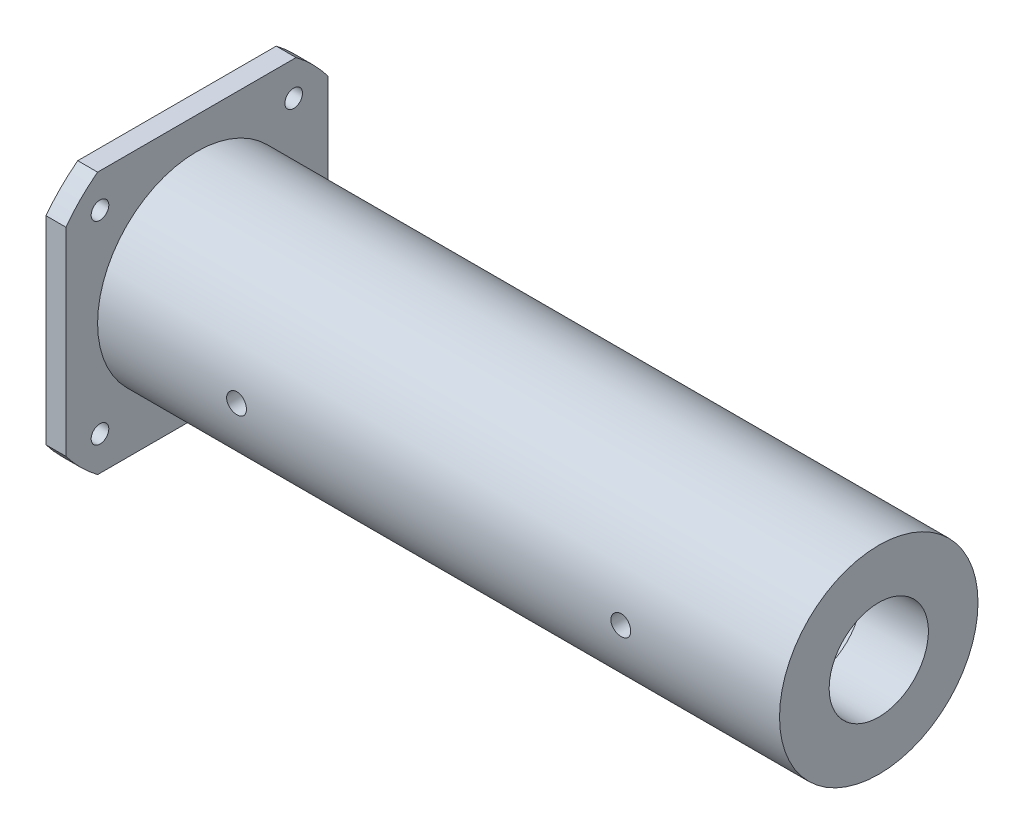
ISO-10303-21;
HEADER;
FILE_DESCRIPTION(('STEP AP214'),'2;1');
FILE_NAME('part.step','',(''),(''),'','','');
FILE_SCHEMA(('AUTOMOTIVE_DESIGN { 1 0 10303 214 1 1 1 1 }'));
ENDSEC;
DATA;
#1=APPLICATION_CONTEXT('core data for automotive mechanical design processes');
#2=APPLICATION_PROTOCOL_DEFINITION('international standard','automotive_design',2000,#1);
#3=PRODUCT_CONTEXT('',#1,'mechanical');
#4=PRODUCT('Part','Part','',(#3));
#5=PRODUCT_RELATED_PRODUCT_CATEGORY('part','',(#4));
#6=PRODUCT_DEFINITION_FORMATION('','',#4);
#7=PRODUCT_DEFINITION_CONTEXT('part definition',#1,'design');
#8=PRODUCT_DEFINITION('design','',#6,#7);
#9=PRODUCT_DEFINITION_SHAPE('','',#8);
#10=(LENGTH_UNIT() NAMED_UNIT(*) SI_UNIT(.MILLI.,.METRE.));
#11=(NAMED_UNIT(*) PLANE_ANGLE_UNIT() SI_UNIT($,.RADIAN.));
#12=(NAMED_UNIT(*) SI_UNIT($,.STERADIAN.) SOLID_ANGLE_UNIT());
#13=UNCERTAINTY_MEASURE_WITH_UNIT(LENGTH_MEASURE(1.E-05),#10,'distance_accuracy_value','');
#14=(GEOMETRIC_REPRESENTATION_CONTEXT(3) GLOBAL_UNCERTAINTY_ASSIGNED_CONTEXT((#13)) GLOBAL_UNIT_ASSIGNED_CONTEXT((#10,
#11,#12)) REPRESENTATION_CONTEXT('',''));
#15=CARTESIAN_POINT('',(0.,0.,0.));
#16=DIRECTION('',(0.,0.,1.));
#17=DIRECTION('',(1.,0.,0.));
#18=AXIS2_PLACEMENT_3D('',#15,#16,#17);
#19=CARTESIAN_POINT('',(3.17500000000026,26.289,0.));
#20=DIRECTION('',(-1.,0.,0.));
#21=DIRECTION('',(0.,0.,0.999999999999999));
#22=AXIS2_PLACEMENT_3D('',#19,#20,#21);
#23=PLANE('',#22);
#24=CARTESIAN_POINT('',(3.17500000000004,-15.494,-15.494));
#25=DIRECTION('',(-1.,0.,0.));
#26=DIRECTION('',(0.,0.,0.999999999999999));
#27=AXIS2_PLACEMENT_3D('',#24,#25,#26);
#28=CIRCLE('',#27,1.4097);
#29=CARTESIAN_POINT('',(3.17500000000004,-15.494,-14.0843));
#30=VERTEX_POINT('',#29);
#31=EDGE_CURVE('E168',#30,#30,#28,.F.);
#32=ORIENTED_EDGE('',*,*,#31,.F.);
#33=EDGE_LOOP('',(#32));
#34=FACE_BOUND('',#33,.T.);
#35=CARTESIAN_POINT('',(3.17500000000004,15.5014705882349,15.494));
#36=DIRECTION('',(-1.,0.,0.));
#37=DIRECTION('',(0.,0.,0.999999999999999));
#38=AXIS2_PLACEMENT_3D('',#35,#36,#37);
#39=CIRCLE('',#38,1.4097);
#40=CARTESIAN_POINT('',(3.17500000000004,15.5014705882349,16.9037));
#41=VERTEX_POINT('',#40);
#42=EDGE_CURVE('E180',#41,#41,#39,.F.);
#43=ORIENTED_EDGE('',*,*,#42,.F.);
#44=EDGE_LOOP('',(#43));
#45=FACE_BOUND('',#44,.T.);
#46=CARTESIAN_POINT('',(3.17500000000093,0.,0.));
#47=DIRECTION('',(-1.,0.,0.));
#48=DIRECTION('',(0.,0.,0.999999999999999));
#49=AXIS2_PLACEMENT_3D('',#46,#47,#48);
#50=CIRCLE('',#49,26.289);
#51=CARTESIAN_POINT('',(3.17499999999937,15.8744919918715,20.9550000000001));
#52=VERTEX_POINT('',#51);
#53=CARTESIAN_POINT('',(3.17500000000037,20.9549999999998,15.8744919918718));
#54=VERTEX_POINT('',#53);
#55=EDGE_CURVE('E11',#52,#54,#50,.T.);
#56=ORIENTED_EDGE('',*,*,#55,.F.);
#57=DIRECTION('',(0.,-0.999999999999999,0.));
#58=VECTOR('',#57,1.);
#59=CARTESIAN_POINT('',(3.17500000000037,26.289,20.955));
#60=LINE('',#59,#58);
#61=CARTESIAN_POINT('',(3.17499999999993,-15.8744919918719,20.955));
#62=VERTEX_POINT('',#61);
#63=EDGE_CURVE('E220',#52,#62,#60,.T.);
#64=ORIENTED_EDGE('',*,*,#63,.T.);
#65=CARTESIAN_POINT('',(3.17500000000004,-20.9550000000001,15.8744919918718));
#66=VERTEX_POINT('',#65);
#67=EDGE_CURVE('E43',#66,#62,#50,.T.);
#68=ORIENTED_EDGE('',*,*,#67,.F.);
#69=DIRECTION('',(0.,0.,-0.999999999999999));
#70=VECTOR('',#69,1.);
#71=CARTESIAN_POINT('',(3.17500000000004,-20.955,0.));
#72=LINE('',#71,#70);
#73=CARTESIAN_POINT('',(3.17500000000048,-20.9550000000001,-15.8744919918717));
#74=VERTEX_POINT('',#73);
#75=EDGE_CURVE('E217',#66,#74,#72,.T.);
#76=ORIENTED_EDGE('',*,*,#75,.T.);
#77=CARTESIAN_POINT('',(3.17500000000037,-15.8744919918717,-20.955));
#78=VERTEX_POINT('',#77);
#79=EDGE_CURVE('E392',#78,#74,#50,.T.);
#80=ORIENTED_EDGE('',*,*,#79,.F.);
#81=DIRECTION('',(0.,0.999999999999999,0.));
#82=VECTOR('',#81,1.);
#83=CARTESIAN_POINT('',(3.17499999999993,26.2889999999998,-20.955));
#84=LINE('',#83,#82);
#85=CARTESIAN_POINT('',(3.17500000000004,15.8744919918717,-20.9549999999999));
#86=VERTEX_POINT('',#85);
#87=EDGE_CURVE('E214',#78,#86,#84,.T.);
#88=ORIENTED_EDGE('',*,*,#87,.T.);
#89=CARTESIAN_POINT('',(3.17499999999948,20.9549999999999,-15.8744919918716));
#90=VERTEX_POINT('',#89);
#91=EDGE_CURVE('E41',#90,#86,#50,.T.);
#92=ORIENTED_EDGE('',*,*,#91,.F.);
#93=DIRECTION('',(0.,0.,0.999999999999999));
#94=VECTOR('',#93,1.);
#95=CARTESIAN_POINT('',(3.17499999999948,20.9549999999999,0.));
#96=LINE('',#95,#94);
#97=EDGE_CURVE('E211',#90,#54,#96,.T.);
#98=ORIENTED_EDGE('',*,*,#97,.T.);
#99=EDGE_LOOP('',(#56,#64,#68,#76,#80,#88,#92,#98));
#100=FACE_BOUND('',#99,.T.);
#101=CARTESIAN_POINT('',(3.17500000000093,0.,0.));
#102=DIRECTION('',(-1.,0.,0.));
#103=DIRECTION('',(0.,0.,0.999999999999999));
#104=AXIS2_PLACEMENT_3D('',#101,#102,#103);
#105=CIRCLE('',#104,15.875);
#106=CARTESIAN_POINT('',(3.17500000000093,0.,15.875));
#107=VERTEX_POINT('',#106);
#108=EDGE_CURVE('E243',#107,#107,#105,.T.);
#109=ORIENTED_EDGE('',*,*,#108,.T.);
#110=EDGE_LOOP('',(#109));
#111=FACE_BOUND('',#110,.T.);
#112=CARTESIAN_POINT('',(3.17500000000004,15.5014705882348,-15.494));
#113=DIRECTION('',(-1.,0.,0.));
#114=DIRECTION('',(0.,0.,0.999999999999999));
#115=AXIS2_PLACEMENT_3D('',#112,#113,#114);
#116=CIRCLE('',#115,1.4097);
#117=CARTESIAN_POINT('',(3.17500000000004,15.5014705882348,-14.0843));
#118=VERTEX_POINT('',#117);
#119=EDGE_CURVE('E174',#118,#118,#116,.F.);
#120=ORIENTED_EDGE('',*,*,#119,.F.);
#121=EDGE_LOOP('',(#120));
#122=FACE_BOUND('',#121,.T.);
#123=CARTESIAN_POINT('',(3.17499999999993,-15.4940000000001,15.494));
#124=DIRECTION('',(-1.,0.,0.));
#125=DIRECTION('',(0.,0.,0.999999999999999));
#126=AXIS2_PLACEMENT_3D('',#123,#124,#125);
#127=CIRCLE('',#126,1.4097);
#128=CARTESIAN_POINT('',(3.17499999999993,-15.4940000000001,16.9037));
#129=VERTEX_POINT('',#128);
#130=EDGE_CURVE('E162',#129,#129,#127,.F.);
#131=ORIENTED_EDGE('',*,*,#130,.F.);
#132=EDGE_LOOP('',(#131));
#133=FACE_BOUND('',#132,.T.);
#134=ADVANCED_FACE('F32',(#34,#45,#100,#111,#122,#133),#23,.F.);
#135=CARTESIAN_POINT('',(-7.7715611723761E-13,14.2748,0.));
#136=DIRECTION('',(1.,0.,0.));
#137=DIRECTION('',(0.,0.,-0.999999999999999));
#138=AXIS2_PLACEMENT_3D('',#135,#136,#137);
#139=PLANE('',#138);
#140=CARTESIAN_POINT('',(4.44089209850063E-13,-15.494,-15.494));
#141=DIRECTION('',(1.,0.,0.));
#142=DIRECTION('',(0.,0.,-0.999999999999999));
#143=AXIS2_PLACEMENT_3D('',#140,#141,#142);
#144=CIRCLE('',#143,1.4097);
#145=CARTESIAN_POINT('',(4.44167463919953E-13,-15.494,-16.9037));
#146=VERTEX_POINT('',#145);
#147=EDGE_CURVE('E165',#146,#146,#144,.T.);
#148=ORIENTED_EDGE('',*,*,#147,.T.);
#149=EDGE_LOOP('',(#148));
#150=FACE_BOUND('',#149,.T.);
#151=CARTESIAN_POINT('',(3.33066907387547E-13,15.5014705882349,15.494));
#152=DIRECTION('',(1.,0.,0.));
#153=DIRECTION('',(0.,0.,-0.999999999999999));
#154=AXIS2_PLACEMENT_3D('',#151,#152,#153);
#155=CIRCLE('',#154,1.4097);
#156=CARTESIAN_POINT('',(3.33145161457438E-13,15.5014705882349,14.0843));
#157=VERTEX_POINT('',#156);
#158=EDGE_CURVE('E177',#157,#157,#155,.T.);
#159=ORIENTED_EDGE('',*,*,#158,.T.);
#160=EDGE_LOOP('',(#159));
#161=FACE_BOUND('',#160,.T.);
#162=CARTESIAN_POINT('',(-4.44089209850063E-13,0.,0.));
#163=DIRECTION('',(-1.,0.,0.));
#164=DIRECTION('',(0.,0.,0.999999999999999));
#165=AXIS2_PLACEMENT_3D('',#162,#163,#164);
#166=CIRCLE('',#165,14.2748);
#167=CARTESIAN_POINT('',(-4.44881620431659E-13,0.,14.2748));
#168=VERTEX_POINT('',#167);
#169=EDGE_CURVE('E227',#168,#168,#166,.T.);
#170=ORIENTED_EDGE('',*,*,#169,.F.);
#171=EDGE_LOOP('',(#170));
#172=FACE_BOUND('',#171,.T.);
#173=CARTESIAN_POINT('',(-4.44089209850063E-13,0.,0.));
#174=DIRECTION('',(-1.,0.,0.));
#175=DIRECTION('',(0.,0.,0.999999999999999));
#176=AXIS2_PLACEMENT_3D('',#173,#174,#175);
#177=CIRCLE('',#176,26.289);
#178=CARTESIAN_POINT('',(-1.11022302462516E-13,-20.955,15.8744919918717));
#179=VERTEX_POINT('',#178);
#180=CARTESIAN_POINT('',(3.33066907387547E-13,-15.8744919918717,20.955));
#181=VERTEX_POINT('',#180);
#182=EDGE_CURVE('E223',#179,#181,#177,.T.);
#183=ORIENTED_EDGE('',*,*,#182,.T.);
#184=DIRECTION('',(0.,-0.999999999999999,0.));
#185=VECTOR('',#184,1.);
#186=CARTESIAN_POINT('',(3.33066907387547E-13,-15.8744919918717,20.955));
#187=LINE('',#186,#185);
#188=CARTESIAN_POINT('',(-2.22044604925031E-13,15.8744919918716,20.9550000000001));
#189=VERTEX_POINT('',#188);
#190=EDGE_CURVE('E183',#189,#181,#187,.T.);
#191=ORIENTED_EDGE('',*,*,#190,.F.);
#192=CARTESIAN_POINT('',(1.11022302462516E-13,20.9549999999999,15.8744919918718));
#193=VERTEX_POINT('',#192);
#194=EDGE_CURVE('E224',#189,#193,#177,.T.);
#195=ORIENTED_EDGE('',*,*,#194,.T.);
#196=DIRECTION('',(0.,0.,0.999999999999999));
#197=VECTOR('',#196,1.);
#198=CARTESIAN_POINT('',(1.11022302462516E-13,20.9549999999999,15.8744919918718));
#199=LINE('',#198,#197);
#200=CARTESIAN_POINT('',(-4.44089209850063E-13,20.9549999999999,-15.8744919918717));
#201=VERTEX_POINT('',#200);
#202=EDGE_CURVE('E189',#201,#193,#199,.T.);
#203=ORIENTED_EDGE('',*,*,#202,.F.);
#204=CARTESIAN_POINT('',(1.11022302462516E-13,15.8744919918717,-20.9549999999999));
#205=VERTEX_POINT('',#204);
#206=EDGE_CURVE('E228',#201,#205,#177,.T.);
#207=ORIENTED_EDGE('',*,*,#206,.T.);
#208=DIRECTION('',(0.,0.999999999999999,0.));
#209=VECTOR('',#208,1.);
#210=CARTESIAN_POINT('',(1.11022302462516E-13,15.8744919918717,-20.9549999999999));
#211=LINE('',#210,#209);
#212=CARTESIAN_POINT('',(4.44089209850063E-13,-15.8744919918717,-20.955));
#213=VERTEX_POINT('',#212);
#214=EDGE_CURVE('E187',#213,#205,#211,.T.);
#215=ORIENTED_EDGE('',*,*,#214,.F.);
#216=CARTESIAN_POINT('',(-3.33066907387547E-13,-20.9550000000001,-15.8744919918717));
#217=VERTEX_POINT('',#216);
#218=EDGE_CURVE('E403',#213,#217,#177,.T.);
#219=ORIENTED_EDGE('',*,*,#218,.T.);
#220=DIRECTION('',(0.,0.,-0.999999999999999));
#221=VECTOR('',#220,1.);
#222=CARTESIAN_POINT('',(-3.33066907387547E-13,-20.9550000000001,-15.8744919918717));
#223=LINE('',#222,#221);
#224=EDGE_CURVE('E185',#179,#217,#223,.T.);
#225=ORIENTED_EDGE('',*,*,#224,.F.);
#226=EDGE_LOOP('',(#183,#191,#195,#203,#207,#215,#219,#225));
#227=FACE_BOUND('',#226,.T.);
#228=CARTESIAN_POINT('',(1.11022302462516E-13,15.5014705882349,-15.494));
#229=DIRECTION('',(1.,0.,0.));
#230=DIRECTION('',(0.,0.,-0.999999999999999));
#231=AXIS2_PLACEMENT_3D('',#228,#229,#230);
#232=CIRCLE('',#231,1.4097);
#233=CARTESIAN_POINT('',(1.11100556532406E-13,15.5014705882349,-16.9037));
#234=VERTEX_POINT('',#233);
#235=EDGE_CURVE('E171',#234,#234,#232,.T.);
#236=ORIENTED_EDGE('',*,*,#235,.T.);
#237=EDGE_LOOP('',(#236));
#238=FACE_BOUND('',#237,.T.);
#239=CARTESIAN_POINT('',(2.22044604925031E-13,-15.4940000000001,15.494));
#240=DIRECTION('',(1.,0.,0.));
#241=DIRECTION('',(0.,0.,-0.999999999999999));
#242=AXIS2_PLACEMENT_3D('',#239,#240,#241);
#243=CIRCLE('',#242,1.4097);
#244=CARTESIAN_POINT('',(2.22122858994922E-13,-15.4940000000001,14.0843));
#245=VERTEX_POINT('',#244);
#246=EDGE_CURVE('E159',#245,#245,#243,.T.);
#247=ORIENTED_EDGE('',*,*,#246,.T.);
#248=EDGE_LOOP('',(#247));
#249=FACE_BOUND('',#248,.T.);
#250=ADVANCED_FACE('F303',(#150,#161,#172,#227,#238,#249),#139,.F.);
#251=CARTESIAN_POINT('',(-4.44089209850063E-13,0.,0.));
#252=DIRECTION('',(-1.,0.,0.));
#253=DIRECTION('',(0.,0.,0.999999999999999));
#254=AXIS2_PLACEMENT_3D('',#251,#252,#253);
#255=CYLINDRICAL_SURFACE('',#254,26.289);
#256=ORIENTED_EDGE('',*,*,#67,.T.);
#257=DIRECTION('',(-1.,0.,0.));
#258=VECTOR('',#257,1.);
#259=CARTESIAN_POINT('',(112.268,-15.8744919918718,20.955));
#260=LINE('',#259,#258);
#261=EDGE_CURVE('E206',#62,#181,#260,.T.);
#262=ORIENTED_EDGE('',*,*,#261,.T.);
#263=ORIENTED_EDGE('',*,*,#182,.F.);
#264=DIRECTION('',(-1.,0.,0.));
#265=VECTOR('',#264,1.);
#266=CARTESIAN_POINT('',(112.268,-20.955,15.8744919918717));
#267=LINE('',#266,#265);
#268=EDGE_CURVE('E204',#66,#179,#267,.T.);
#269=ORIENTED_EDGE('',*,*,#268,.F.);
#270=EDGE_LOOP('',(#256,#262,#263,#269));
#271=FACE_BOUND('',#270,.T.);
#272=ADVANCED_FACE('F325',(#271),#255,.T.);
#273=ORIENTED_EDGE('',*,*,#79,.T.);
#274=DIRECTION('',(-1.,0.,0.));
#275=VECTOR('',#274,1.);
#276=CARTESIAN_POINT('',(112.268,-20.9550000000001,-15.8744919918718));
#277=LINE('',#276,#275);
#278=EDGE_CURVE('E201',#74,#217,#277,.T.);
#279=ORIENTED_EDGE('',*,*,#278,.T.);
#280=ORIENTED_EDGE('',*,*,#218,.F.);
#281=DIRECTION('',(-1.,0.,0.));
#282=VECTOR('',#281,1.);
#283=CARTESIAN_POINT('',(112.268,-15.8744919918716,-20.955));
#284=LINE('',#283,#282);
#285=EDGE_CURVE('E199',#78,#213,#284,.T.);
#286=ORIENTED_EDGE('',*,*,#285,.F.);
#287=EDGE_LOOP('',(#273,#279,#280,#286));
#288=FACE_BOUND('',#287,.T.);
#289=ADVANCED_FACE('F402',(#288),#255,.T.);
#290=ORIENTED_EDGE('',*,*,#91,.T.);
#291=DIRECTION('',(-1.,0.,0.));
#292=VECTOR('',#291,1.);
#293=CARTESIAN_POINT('',(112.267999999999,15.8744919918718,-20.9549999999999));
#294=LINE('',#293,#292);
#295=EDGE_CURVE('E196',#86,#205,#294,.T.);
#296=ORIENTED_EDGE('',*,*,#295,.T.);
#297=ORIENTED_EDGE('',*,*,#206,.F.);
#298=DIRECTION('',(-1.,0.,0.));
#299=VECTOR('',#298,1.);
#300=CARTESIAN_POINT('',(112.267999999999,20.9549999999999,-15.8744919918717));
#301=LINE('',#300,#299);
#302=EDGE_CURVE('E194',#90,#201,#301,.T.);
#303=ORIENTED_EDGE('',*,*,#302,.F.);
#304=EDGE_LOOP('',(#290,#296,#297,#303));
#305=FACE_BOUND('',#304,.T.);
#306=ADVANCED_FACE('F407',(#305),#255,.T.);
#307=ORIENTED_EDGE('',*,*,#194,.F.);
#308=DIRECTION('',(-1.,0.,0.));
#309=VECTOR('',#308,1.);
#310=CARTESIAN_POINT('',(112.268,15.8744919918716,20.9550000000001));
#311=LINE('',#310,#309);
#312=EDGE_CURVE('E209',#52,#189,#311,.T.);
#313=ORIENTED_EDGE('',*,*,#312,.F.);
#314=ORIENTED_EDGE('',*,*,#55,.T.);
#315=DIRECTION('',(-1.,0.,0.));
#316=VECTOR('',#315,1.);
#317=CARTESIAN_POINT('',(112.268,20.9549999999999,15.8744919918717));
#318=LINE('',#317,#316);
#319=EDGE_CURVE('E191',#54,#193,#318,.T.);
#320=ORIENTED_EDGE('',*,*,#319,.T.);
#321=EDGE_LOOP('',(#307,#313,#314,#320));
#322=FACE_BOUND('',#321,.T.);
#323=ADVANCED_FACE('F34',(#322),#255,.T.);
#324=CARTESIAN_POINT('',(-4.44089209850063E-13,0.,0.));
#325=DIRECTION('',(-1.,0.,0.));
#326=DIRECTION('',(0.,0.,0.999999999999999));
#327=AXIS2_PLACEMENT_3D('',#324,#325,#326);
#328=CYLINDRICAL_SURFACE('',#327,15.875);
#329=CARTESIAN_POINT('',(88.4555000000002,-1.11022302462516E-13,15.8750000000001));
#330=CARTESIAN_POINT('',(88.4554961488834,-0.0889323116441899,15.8749989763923));
#331=CARTESIAN_POINT('',(88.448001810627,-0.177923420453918,15.8742447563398));
#332=CARTESIAN_POINT('',(88.4182185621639,-0.353438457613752,15.8713085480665));
#333=CARTESIAN_POINT('',(88.3959133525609,-0.439959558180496,15.8691249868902));
#334=CARTESIAN_POINT('',(88.3371641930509,-0.607967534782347,15.8635765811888));
#335=CARTESIAN_POINT('',(88.300728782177,-0.68945741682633,15.8602124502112));
#336=CARTESIAN_POINT('',(88.2147700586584,-0.845147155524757,15.8526790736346));
#337=CARTESIAN_POINT('',(88.1652493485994,-0.919348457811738,15.8485099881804));
#338=CARTESIAN_POINT('',(88.0543344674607,-1.05863953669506,15.8398169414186));
#339=CARTESIAN_POINT('',(87.9929028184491,-1.12369940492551,15.8352918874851));
#340=CARTESIAN_POINT('',(87.8599898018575,-1.24260375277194,15.8264059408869));
#341=CARTESIAN_POINT('',(87.7885079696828,-1.29644771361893,15.8220450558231));
#342=CARTESIAN_POINT('',(87.6373365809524,-1.39149767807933,15.8139700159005));
#343=CARTESIAN_POINT('',(87.5576299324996,-1.43267662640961,15.8102572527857));
#344=CARTESIAN_POINT('',(87.3923900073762,-1.50105488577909,15.8039123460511));
#345=CARTESIAN_POINT('',(87.3068568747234,-1.52825454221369,15.8012801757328));
#346=CARTESIAN_POINT('',(87.1326968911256,-1.56781347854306,15.7974043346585));
#347=CARTESIAN_POINT('',(87.0440814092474,-1.58022234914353,15.7961560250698));
#348=CARTESIAN_POINT('',(86.8660174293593,-1.59000076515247,15.7951748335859));
#349=CARTESIAN_POINT('',(86.7765689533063,-1.5873707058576,15.7954419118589));
#350=CARTESIAN_POINT('',(86.5997199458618,-1.56718679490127,15.7974570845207));
#351=CARTESIAN_POINT('',(86.5123131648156,-1.54968709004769,15.7991998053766));
#352=CARTESIAN_POINT('',(86.341683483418,-1.50034489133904,15.8039615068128));
#353=CARTESIAN_POINT('',(86.2584606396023,-1.46850220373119,15.8069805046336));
#354=CARTESIAN_POINT('',(86.0983901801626,-1.39131816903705,15.8139607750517));
#355=CARTESIAN_POINT('',(86.0215542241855,-1.3459527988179,15.817923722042));
#356=CARTESIAN_POINT('',(85.8765662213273,-1.24302841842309,15.8263439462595));
#357=CARTESIAN_POINT('',(85.8084144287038,-1.18546905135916,15.830801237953));
#358=CARTESIAN_POINT('',(85.6824146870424,-1.05948815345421,15.8397318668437));
#359=CARTESIAN_POINT('',(85.6246134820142,-0.991019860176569,15.8442051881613));
#360=CARTESIAN_POINT('',(85.5213179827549,-0.845327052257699,15.8526452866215));
#361=CARTESIAN_POINT('',(85.4758237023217,-0.768102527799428,15.8566120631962));
#362=CARTESIAN_POINT('',(85.3984353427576,-0.607056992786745,15.8635934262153));
#363=CARTESIAN_POINT('',(85.3665436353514,-0.523234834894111,15.8666078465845));
#364=CARTESIAN_POINT('',(85.3172999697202,-0.351388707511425,15.8713431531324));
#365=CARTESIAN_POINT('',(85.29994757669,-0.263364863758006,15.8730640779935));
#366=CARTESIAN_POINT('',(85.2803344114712,-0.0860188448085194,15.8750135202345));
#367=CARTESIAN_POINT('',(85.2780091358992,0.00329612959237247,15.8752484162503));
#368=CARTESIAN_POINT('',(85.2883467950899,0.181044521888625,15.8742164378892));
#369=CARTESIAN_POINT('',(85.301009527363,0.269477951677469,15.872949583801));
#370=CARTESIAN_POINT('',(85.3409102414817,0.442766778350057,15.8690605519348));
#371=CARTESIAN_POINT('',(85.3681180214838,0.527629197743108,15.8664411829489));
#372=CARTESIAN_POINT('',(85.4363054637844,0.691585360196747,15.8601409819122));
#373=CARTESIAN_POINT('',(85.4772854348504,0.770678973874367,15.8564601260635));
#374=CARTESIAN_POINT('',(85.5720139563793,0.921143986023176,15.8484327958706));
#375=CARTESIAN_POINT('',(85.6258048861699,0.992488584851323,15.8440841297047));
#376=CARTESIAN_POINT('',(85.7445676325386,1.12515907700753,15.8352161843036));
#377=CARTESIAN_POINT('',(85.8095397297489,1.18648471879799,15.8306969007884));
#378=CARTESIAN_POINT('',(85.9491019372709,1.29760044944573,15.8219778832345));
#379=CARTESIAN_POINT('',(86.0237258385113,1.34734820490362,15.8177793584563));
#380=CARTESIAN_POINT('',(86.1803066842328,1.43360498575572,15.8101955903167));
#381=CARTESIAN_POINT('',(86.2622635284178,1.47011419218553,15.8068103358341));
#382=CARTESIAN_POINT('',(86.4310386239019,1.52878664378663,15.8012439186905));
#383=CARTESIAN_POINT('',(86.5178480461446,1.55097507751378,15.7990606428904));
#384=CARTESIAN_POINT('',(86.6939833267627,1.58045786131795,15.7961387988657));
#385=CARTESIAN_POINT('',(86.7833091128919,1.5877526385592,15.7954001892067));
#386=CARTESIAN_POINT('',(86.9615207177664,1.58723510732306,15.7954521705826));
#387=CARTESIAN_POINT('',(87.0504067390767,1.57948929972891,15.7962360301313));
#388=CARTESIAN_POINT('',(87.2256080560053,1.54924990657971,15.7992302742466));
#389=CARTESIAN_POINT('',(87.3119233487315,1.52675630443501,15.8014406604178));
#390=CARTESIAN_POINT('',(87.4795325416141,1.46767817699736,15.8070370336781));
#391=CARTESIAN_POINT('',(87.5608271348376,1.43109560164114,15.8104228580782));
#392=CARTESIAN_POINT('',(87.7161328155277,1.34488484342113,15.8179889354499));
#393=CARTESIAN_POINT('',(87.7901439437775,1.29525673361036,15.8221691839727));
#394=CARTESIAN_POINT('',(87.9291225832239,1.184113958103,15.830875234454));
#395=CARTESIAN_POINT('',(87.9940503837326,1.12254974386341,15.8354024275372));
#396=CARTESIAN_POINT('',(88.1126829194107,0.98938032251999,15.8442795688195));
#397=CARTESIAN_POINT('',(88.1663849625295,0.917772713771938,15.8486294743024));
#398=CARTESIAN_POINT('',(88.2611478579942,0.766352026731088,15.8566732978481));
#399=CARTESIAN_POINT('',(88.3021765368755,0.68651873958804,15.8603655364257));
#400=CARTESIAN_POINT('',(88.3701915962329,0.521110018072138,15.8666597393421));
#401=CARTESIAN_POINT('',(88.3971938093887,0.435541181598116,15.8692629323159));
#402=CARTESIAN_POINT('',(88.4296564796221,0.291239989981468,15.8724316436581));
#403=CARTESIAN_POINT('',(88.4393345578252,0.233430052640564,15.8733902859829));
#404=CARTESIAN_POINT('',(88.4522575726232,0.11708857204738,15.8746747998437));
#405=CARTESIAN_POINT('',(88.4555025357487,0.058557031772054,15.8750006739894));
#406=CARTESIAN_POINT('',(88.4555000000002,-1.11022302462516E-13,15.8750000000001));
#407=B_SPLINE_CURVE_WITH_KNOTS('',3,(#329,#330,#331,#332,#333,#334,#335,#336,#337,#338,#339,
#340,#341,#342,#343,#344,#345,#346,#347,#348,#349,#350,#351,#352,#353,#354,#355,#356,#357,#358,
#359,#360,#361,#362,#363,#364,#365,#366,#367,#368,#369,#370,#371,#372,#373,#374,#375,#376,#377,
#378,#379,#380,#381,#382,#383,#384,#385,#386,#387,#388,#389,#390,#391,#392,#393,#394,#395,#396,
#397,#398,#399,#400,#401,#402,#403,#404,#405,#406),.UNSPECIFIED.,.T.,.F.,(4,2,2,2,2,2,2,2,2,2,2,
2,2,2,2,2,2,2,2,2,2,2,2,2,2,2,2,2,2,2,2,2,2,2,2,2,2,2,4),(0.,0.266583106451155,0.53346007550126,
0.800176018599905,1.06683895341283,1.334354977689,1.60188337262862,1.86997936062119,
2.13806872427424,2.40525668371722,2.67243762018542,2.93864978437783,3.20486554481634,
3.47155708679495,3.73825643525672,4.00613140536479,4.27400667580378,4.54192863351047,
4.80984257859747,5.07660574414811,5.3433653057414,5.60957309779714,5.87578685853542,
6.14289380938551,6.41000746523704,6.6780829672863,6.9461548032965,7.21375383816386,
7.48134519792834,7.74775611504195,8.01416733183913,8.2805416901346,8.5469145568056,
8.81441781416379,9.08198514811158,9.35022626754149,9.61816394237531,9.79369496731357,
9.96922526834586),.UNSPECIFIED.);
#408=CARTESIAN_POINT('',(88.4555000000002,-1.11022302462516E-13,15.8750000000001));
#409=VERTEX_POINT('',#408);
#410=EDGE_CURVE('E248',#409,#409,#407,.T.);
#411=ORIENTED_EDGE('',*,*,#410,.T.);
#412=EDGE_LOOP('',(#411));
#413=FACE_BOUND('',#412,.T.);
#414=CARTESIAN_POINT('',(88.4554999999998,-1.11022302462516E-13,-15.8749999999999));
#415=CARTESIAN_POINT('',(88.4554961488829,0.08893231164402,-15.8749989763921));
#416=CARTESIAN_POINT('',(88.4480018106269,0.177923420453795,-15.8742447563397));
#417=CARTESIAN_POINT('',(88.418218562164,0.353438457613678,-15.8713085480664));
#418=CARTESIAN_POINT('',(88.3959133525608,0.439959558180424,-15.8691249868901));
#419=CARTESIAN_POINT('',(88.3371641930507,0.607967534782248,-15.8635765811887));
#420=CARTESIAN_POINT('',(88.3007287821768,0.689457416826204,-15.8602124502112));
#421=CARTESIAN_POINT('',(88.2147700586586,0.845147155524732,-15.8526790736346));
#422=CARTESIAN_POINT('',(88.1652493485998,0.91934845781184,-15.8485099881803));
#423=CARTESIAN_POINT('',(88.0543344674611,1.05863953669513,-15.8398169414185));
#424=CARTESIAN_POINT('',(87.9929028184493,1.12369940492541,-15.8352918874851));
#425=CARTESIAN_POINT('',(87.8599898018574,1.24260375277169,-15.8264059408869));
#426=CARTESIAN_POINT('',(87.7885079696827,1.29644771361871,-15.822045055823));
#427=CARTESIAN_POINT('',(87.6373365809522,1.39149767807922,-15.8139700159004));
#428=CARTESIAN_POINT('',(87.5576299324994,1.43267662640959,-15.8102572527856));
#429=CARTESIAN_POINT('',(87.3923900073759,1.50105488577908,-15.8039123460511));
#430=CARTESIAN_POINT('',(87.3068568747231,1.52825454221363,-15.8012801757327));
#431=CARTESIAN_POINT('',(87.1326968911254,1.56781347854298,-15.7974043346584));
#432=CARTESIAN_POINT('',(87.0440814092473,1.58022234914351,-15.7961560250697));
#433=CARTESIAN_POINT('',(86.8660174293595,1.59000076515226,-15.7951748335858));
#434=CARTESIAN_POINT('',(86.7765689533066,1.58737070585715,-15.7954419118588));
#435=CARTESIAN_POINT('',(86.5997199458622,1.56718679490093,-15.7974570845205));
#436=CARTESIAN_POINT('',(86.5123131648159,1.54968709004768,-15.7991998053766));
#437=CARTESIAN_POINT('',(86.3416834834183,1.50034489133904,-15.8039615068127));
#438=CARTESIAN_POINT('',(86.2584606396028,1.46850220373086,-15.8069805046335));
#439=CARTESIAN_POINT('',(86.0983901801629,1.39131816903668,-15.8139607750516));
#440=CARTESIAN_POINT('',(86.0215542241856,1.34595279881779,-15.817923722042));
#441=CARTESIAN_POINT('',(85.8765662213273,1.24302841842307,-15.8263439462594));
#442=CARTESIAN_POINT('',(85.8084144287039,1.18546905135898,-15.8308012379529));
#443=CARTESIAN_POINT('',(85.6824146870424,1.05948815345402,-15.8397318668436));
#444=CARTESIAN_POINT('',(85.6246134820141,0.991019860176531,-15.8442051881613));
#445=CARTESIAN_POINT('',(85.521317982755,0.845327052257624,-15.8526452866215));
#446=CARTESIAN_POINT('',(85.4758237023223,0.768102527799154,-15.856612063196));
#447=CARTESIAN_POINT('',(85.3984353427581,0.607056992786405,-15.8635934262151));
#448=CARTESIAN_POINT('',(85.3665436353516,0.5232348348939,-15.8666078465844));
#449=CARTESIAN_POINT('',(85.31729996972,0.351388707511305,-15.8713431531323));
#450=CARTESIAN_POINT('',(85.2999475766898,0.26336486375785,-15.8730640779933));
#451=CARTESIAN_POINT('',(85.2803344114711,0.0860188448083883,-15.8750135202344));
#452=CARTESIAN_POINT('',(85.2780091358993,-0.00329612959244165,-15.8752484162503));
#453=CARTESIAN_POINT('',(85.2883467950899,-0.181044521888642,-15.8742164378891));
#454=CARTESIAN_POINT('',(85.3010095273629,-0.269477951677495,-15.8729495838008));
#455=CARTESIAN_POINT('',(85.3409102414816,-0.442766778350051,-15.8690605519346));
#456=CARTESIAN_POINT('',(85.3681180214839,-0.52762919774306,-15.8664411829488));
#457=CARTESIAN_POINT('',(85.4363054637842,-0.69158536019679,-15.8601409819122));
#458=CARTESIAN_POINT('',(85.47728543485,-0.770678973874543,-15.8564601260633));
#459=CARTESIAN_POINT('',(85.5720139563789,-0.921143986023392,-15.8484327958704));
#460=CARTESIAN_POINT('',(85.6258048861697,-0.992488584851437,-15.8440841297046));
#461=CARTESIAN_POINT('',(85.7445676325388,-1.12515907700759,-15.8352161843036));
#462=CARTESIAN_POINT('',(85.8095397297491,-1.18648471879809,-15.8306969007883));
#463=CARTESIAN_POINT('',(85.9491019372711,-1.29760044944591,-15.8219778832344));
#464=CARTESIAN_POINT('',(86.0237258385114,-1.34734820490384,-15.8177793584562));
#465=CARTESIAN_POINT('',(86.180306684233,-1.43360498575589,-15.8101955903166));
#466=CARTESIAN_POINT('',(86.262263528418,-1.4701141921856,-15.806810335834));
#467=CARTESIAN_POINT('',(86.4310386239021,-1.52878664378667,-15.8012439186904));
#468=CARTESIAN_POINT('',(86.5178480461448,-1.55097507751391,-15.7990606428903));
#469=CARTESIAN_POINT('',(86.6939833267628,-1.58045786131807,-15.7961387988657));
#470=CARTESIAN_POINT('',(86.7833091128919,-1.58775263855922,-15.7954001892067));
#471=CARTESIAN_POINT('',(86.9615207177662,-1.58723510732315,-15.7954521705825));
#472=CARTESIAN_POINT('',(87.0504067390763,-1.5794892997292,-15.7962360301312));
#473=CARTESIAN_POINT('',(87.2256080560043,-1.54924990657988,-15.7992302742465));
#474=CARTESIAN_POINT('',(87.3119233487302,-1.52675630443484,-15.8014406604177));
#475=CARTESIAN_POINT('',(87.479532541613,-1.46767817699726,-15.807037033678));
#476=CARTESIAN_POINT('',(87.5608271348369,-1.43109560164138,-15.8104228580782));
#477=CARTESIAN_POINT('',(87.7161328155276,-1.3448848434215,-15.8179889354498));
#478=CARTESIAN_POINT('',(87.7901439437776,-1.29525673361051,-15.8221691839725));
#479=CARTESIAN_POINT('',(87.9291225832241,-1.18411395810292,-15.8308752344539));
#480=CARTESIAN_POINT('',(87.9940503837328,-1.12254974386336,-15.8354024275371));
#481=CARTESIAN_POINT('',(88.1126829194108,-0.989380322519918,-15.8442795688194));
#482=CARTESIAN_POINT('',(88.1663849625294,-0.917772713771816,-15.8486294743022));
#483=CARTESIAN_POINT('',(88.2611478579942,-0.766352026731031,-15.8566732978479));
#484=CARTESIAN_POINT('',(88.3021765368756,-0.686518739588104,-15.8603655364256));
#485=CARTESIAN_POINT('',(88.3701915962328,-0.521110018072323,-15.8666597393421));
#486=CARTESIAN_POINT('',(88.3971938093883,-0.435541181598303,-15.8692629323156));
#487=CARTESIAN_POINT('',(88.4296564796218,-0.291239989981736,-15.8724316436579));
#488=CARTESIAN_POINT('',(88.4393345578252,-0.233430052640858,-15.8733902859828));
#489=CARTESIAN_POINT('',(88.4522575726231,-0.117088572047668,-15.8746747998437));
#490=CARTESIAN_POINT('',(88.4555025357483,-0.0585570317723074,-15.8750006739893));
#491=CARTESIAN_POINT('',(88.4554999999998,-1.11022302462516E-13,-15.8749999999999));
#492=B_SPLINE_CURVE_WITH_KNOTS('',3,(#414,#415,#416,#417,#418,#419,#420,#421,#422,#423,#424,
#425,#426,#427,#428,#429,#430,#431,#432,#433,#434,#435,#436,#437,#438,#439,#440,#441,#442,#443,
#444,#445,#446,#447,#448,#449,#450,#451,#452,#453,#454,#455,#456,#457,#458,#459,#460,#461,#462,
#463,#464,#465,#466,#467,#468,#469,#470,#471,#472,#473,#474,#475,#476,#477,#478,#479,#480,#481,
#482,#483,#484,#485,#486,#487,#488,#489,#490,#491),.UNSPECIFIED.,.T.,.F.,(4,2,2,2,2,2,2,2,2,2,2,
2,2,2,2,2,2,2,2,2,2,2,2,2,2,2,2,2,2,2,2,2,2,2,2,2,2,2,4),(0.,0.266583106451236,
0.533460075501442,0.800176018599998,1.06683895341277,1.334354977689,1.6018833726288,
1.86997936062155,2.13806872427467,2.40525668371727,2.67243762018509,2.93864978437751,
3.20486554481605,3.47155708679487,3.73825643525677,4.00613140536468,4.27400667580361,
4.54192863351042,4.80984257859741,5.07660574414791,5.34336530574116,5.60957309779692,
5.87578685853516,6.14289380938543,6.41000746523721,6.67808296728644,6.94615480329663,
7.21375383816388,7.48134519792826,7.74775611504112,8.01416733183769,8.28054169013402,
8.54691455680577,8.81441781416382,9.08198514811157,9.35022626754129,9.61816394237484,
9.79369496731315,9.96922526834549),.UNSPECIFIED.);
#493=CARTESIAN_POINT('',(88.4554999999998,-1.11022302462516E-13,-15.8749999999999));
#494=VERTEX_POINT('',#493);
#495=EDGE_CURVE('E255',#494,#494,#492,.T.);
#496=ORIENTED_EDGE('',*,*,#495,.T.);
#497=EDGE_LOOP('',(#496));
#498=FACE_BOUND('',#497,.T.);
#499=CARTESIAN_POINT('',(26.9875000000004,-1.11022302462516E-13,15.875));
#500=CARTESIAN_POINT('',(26.9874961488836,-0.0889323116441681,15.8749989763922));
#501=CARTESIAN_POINT('',(26.980001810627,-0.177923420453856,15.8742447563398));
#502=CARTESIAN_POINT('',(26.9502185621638,-0.353438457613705,15.8713085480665));
#503=CARTESIAN_POINT('',(26.9279133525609,-0.439959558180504,15.8691249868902));
#504=CARTESIAN_POINT('',(26.869164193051,-0.607967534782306,15.8635765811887));
#505=CARTESIAN_POINT('',(26.8327287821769,-0.689457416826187,15.8602124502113));
#506=CARTESIAN_POINT('',(26.7467700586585,-0.845147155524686,15.8526790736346));
#507=CARTESIAN_POINT('',(26.6972493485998,-0.919348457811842,15.8485099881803));
#508=CARTESIAN_POINT('',(26.5863344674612,-1.05863953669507,15.8398169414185));
#509=CARTESIAN_POINT('',(26.5249028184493,-1.12369940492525,15.8352918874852));
#510=CARTESIAN_POINT('',(26.3919898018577,-1.24260375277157,15.8264059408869));
#511=CARTESIAN_POINT('',(26.3205079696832,-1.29644771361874,15.8220450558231));
#512=CARTESIAN_POINT('',(26.1693365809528,-1.39149767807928,15.8139700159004));
#513=CARTESIAN_POINT('',(26.0896299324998,-1.43267662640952,15.8102572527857));
#514=CARTESIAN_POINT('',(25.9243900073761,-1.50105488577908,15.8039123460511));
#515=CARTESIAN_POINT('',(25.8388568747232,-1.52825454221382,15.8012801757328));
#516=CARTESIAN_POINT('',(25.6646968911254,-1.56781347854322,15.7974043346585));
#517=CARTESIAN_POINT('',(25.5760814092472,-1.58022234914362,15.7961560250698));
#518=CARTESIAN_POINT('',(25.3980174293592,-1.59000076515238,15.7951748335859));
#519=CARTESIAN_POINT('',(25.3085689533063,-1.5873707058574,15.7954419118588));
#520=CARTESIAN_POINT('',(25.1317199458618,-1.56718679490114,15.7974570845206));
#521=CARTESIAN_POINT('',(25.0443131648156,-1.54968709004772,15.7991998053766));
#522=CARTESIAN_POINT('',(24.873683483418,-1.50034489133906,15.8039615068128));
#523=CARTESIAN_POINT('',(24.7904606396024,-1.46850220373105,15.8069805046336));
#524=CARTESIAN_POINT('',(24.6303901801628,-1.39131816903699,15.8139607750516));
#525=CARTESIAN_POINT('',(24.5535542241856,-1.3459527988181,15.817923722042));
#526=CARTESIAN_POINT('',(24.4085662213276,-1.24302841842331,15.8263439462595));
#527=CARTESIAN_POINT('',(24.3404144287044,-1.18546905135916,15.830801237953));
#528=CARTESIAN_POINT('',(24.2144146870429,-1.0594881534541,15.8397318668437));
#529=CARTESIAN_POINT('',(24.1566134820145,-0.991019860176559,15.8442051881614));
#530=CARTESIAN_POINT('',(24.0533179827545,-0.84532705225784,15.8526452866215));
#531=CARTESIAN_POINT('',(24.0078237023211,-0.768102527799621,15.8566120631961));
#532=CARTESIAN_POINT('',(23.930435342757,-0.607056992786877,15.8635934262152));
#533=CARTESIAN_POINT('',(23.8985436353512,-0.523234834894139,15.8666078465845));
#534=CARTESIAN_POINT('',(23.8492999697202,-0.351388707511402,15.8713431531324));
#535=CARTESIAN_POINT('',(23.8319475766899,-0.263364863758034,15.8730640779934));
#536=CARTESIAN_POINT('',(23.812334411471,-0.0860188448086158,15.8750135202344));
#537=CARTESIAN_POINT('',(23.8100091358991,0.00329612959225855,15.8752484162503));
#538=CARTESIAN_POINT('',(23.8203467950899,0.181044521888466,15.8742164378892));
#539=CARTESIAN_POINT('',(23.833009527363,0.269477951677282,15.8729495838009));
#540=CARTESIAN_POINT('',(23.8729102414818,0.442766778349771,15.8690605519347));
#541=CARTESIAN_POINT('',(23.9001180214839,0.527629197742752,15.8664411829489));
#542=CARTESIAN_POINT('',(23.9683054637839,0.691585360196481,15.8601409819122));
#543=CARTESIAN_POINT('',(24.0092854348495,0.770678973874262,15.8564601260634));
#544=CARTESIAN_POINT('',(24.1040139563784,0.921143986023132,15.8484327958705));
#545=CARTESIAN_POINT('',(24.1578048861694,0.992488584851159,15.8440841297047));
#546=CARTESIAN_POINT('',(24.2765676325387,1.12515907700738,15.8352161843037));
#547=CARTESIAN_POINT('',(24.3415397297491,1.18648471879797,15.8306969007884));
#548=CARTESIAN_POINT('',(24.4811019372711,1.29760044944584,15.8219778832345));
#549=CARTESIAN_POINT('',(24.5557258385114,1.34734820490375,15.8177793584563));
#550=CARTESIAN_POINT('',(24.7123066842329,1.43360498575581,15.8101955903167));
#551=CARTESIAN_POINT('',(24.7942635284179,1.47011419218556,15.8068103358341));
#552=CARTESIAN_POINT('',(24.9630386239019,1.52878664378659,15.8012439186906));
#553=CARTESIAN_POINT('',(25.0498480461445,1.55097507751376,15.7990606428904));
#554=CARTESIAN_POINT('',(25.2259833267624,1.58045786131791,15.7961387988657));
#555=CARTESIAN_POINT('',(25.3153091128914,1.58775263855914,15.7954001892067));
#556=CARTESIAN_POINT('',(25.4935207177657,1.58723510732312,15.7954521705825));
#557=CARTESIAN_POINT('',(25.582406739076,1.57948929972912,15.7962360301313));
#558=CARTESIAN_POINT('',(25.7576080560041,1.5492499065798,15.7992302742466));
#559=CARTESIAN_POINT('',(25.8439233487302,1.52675630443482,15.8014406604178));
#560=CARTESIAN_POINT('',(26.011532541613,1.4676781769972,15.8070370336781));
#561=CARTESIAN_POINT('',(26.0928271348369,1.43109560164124,15.8104228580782));
#562=CARTESIAN_POINT('',(26.2481328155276,1.34488484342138,15.8179889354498));
#563=CARTESIAN_POINT('',(26.3221439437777,1.29525673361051,15.8221691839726));
#564=CARTESIAN_POINT('',(26.4611225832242,1.18411395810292,15.8308752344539));
#565=CARTESIAN_POINT('',(26.5260503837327,1.12254974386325,15.8354024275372));
#566=CARTESIAN_POINT('',(26.6446829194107,0.989380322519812,15.8442795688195));
#567=CARTESIAN_POINT('',(26.6983849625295,0.917772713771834,15.8486294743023));
#568=CARTESIAN_POINT('',(26.7931478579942,0.766352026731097,15.856673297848));
#569=CARTESIAN_POINT('',(26.8341765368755,0.68651873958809,15.8603655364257));
#570=CARTESIAN_POINT('',(26.9021915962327,0.521110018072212,15.8666597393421));
#571=CARTESIAN_POINT('',(26.9291938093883,0.435541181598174,15.8692629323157));
#572=CARTESIAN_POINT('',(26.9616564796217,0.291239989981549,15.872431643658));
#573=CARTESIAN_POINT('',(26.971334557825,0.233430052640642,15.8733902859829));
#574=CARTESIAN_POINT('',(26.9842575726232,0.117088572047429,15.8746747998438));
#575=CARTESIAN_POINT('',(26.9875025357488,0.0585570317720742,15.8750006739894));
#576=CARTESIAN_POINT('',(26.9875000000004,-1.11022302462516E-13,15.875));
#577=B_SPLINE_CURVE_WITH_KNOTS('',3,(#499,#500,#501,#502,#503,#504,#505,#506,#507,#508,#509,
#510,#511,#512,#513,#514,#515,#516,#517,#518,#519,#520,#521,#522,#523,#524,#525,#526,#527,#528,
#529,#530,#531,#532,#533,#534,#535,#536,#537,#538,#539,#540,#541,#542,#543,#544,#545,#546,#547,
#548,#549,#550,#551,#552,#553,#554,#555,#556,#557,#558,#559,#560,#561,#562,#563,#564,#565,#566,
#567,#568,#569,#570,#571,#572,#573,#574,#575,#576),.UNSPECIFIED.,.T.,.F.,(4,2,2,2,2,2,2,2,2,2,2,
2,2,2,2,2,2,2,2,2,2,2,2,2,2,2,2,2,2,2,2,2,2,2,2,2,2,2,4),(0.,0.266583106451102,0.53346007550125,
0.800176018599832,1.06683895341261,1.33435497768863,1.6018833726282,1.86997936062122,
2.13806872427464,2.40525668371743,2.67243762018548,2.93864978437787,3.2048655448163,
3.47155708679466,3.73825643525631,4.00613140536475,4.27400667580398,4.54192863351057,
4.80984257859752,5.07660574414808,5.34336530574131,5.60957309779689,5.87578685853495,
6.14289380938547,6.41000746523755,6.67808296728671,6.94615480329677,7.21375383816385,
7.48134519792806,7.74775611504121,8.01416733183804,8.28054169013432,8.54691455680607,
8.81441781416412,9.08198514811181,9.35022626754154,9.61816394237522,9.7936949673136,
9.96922526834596),.UNSPECIFIED.);
#578=CARTESIAN_POINT('',(26.9875000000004,-1.11022302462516E-13,15.875));
#579=VERTEX_POINT('',#578);
#580=EDGE_CURVE('E529',#579,#579,#577,.T.);
#581=ORIENTED_EDGE('',*,*,#580,.T.);
#582=EDGE_LOOP('',(#581));
#583=FACE_BOUND('',#582,.T.);
#584=CARTESIAN_POINT('',(26.9874999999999,0.,-15.875));
#585=CARTESIAN_POINT('',(26.987496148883,0.0889323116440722,-15.8749989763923));
#586=CARTESIAN_POINT('',(26.9800018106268,0.177923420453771,-15.8742447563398));
#587=CARTESIAN_POINT('',(26.950218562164,0.353438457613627,-15.8713085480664));
#588=CARTESIAN_POINT('',(26.927913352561,0.439959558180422,-15.8691249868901));
#589=CARTESIAN_POINT('',(26.8691641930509,0.607967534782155,-15.8635765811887));
#590=CARTESIAN_POINT('',(26.8327287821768,0.689457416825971,-15.8602124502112));
#591=CARTESIAN_POINT('',(26.7467700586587,0.845147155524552,-15.8526790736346));
#592=CARTESIAN_POINT('',(26.6972493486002,0.919348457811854,-15.8485099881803));
#593=CARTESIAN_POINT('',(26.5863344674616,1.05863953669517,-15.8398169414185));
#594=CARTESIAN_POINT('',(26.5249028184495,1.12369940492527,-15.8352918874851));
#595=CARTESIAN_POINT('',(26.3919898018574,1.24260375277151,-15.8264059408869));
#596=CARTESIAN_POINT('',(26.3205079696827,1.29644771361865,-15.8220450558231));
#597=CARTESIAN_POINT('',(26.1693365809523,1.39149767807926,-15.8139700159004));
#598=CARTESIAN_POINT('',(26.0896299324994,1.43267662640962,-15.8102572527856));
#599=CARTESIAN_POINT('',(25.9243900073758,1.50105488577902,-15.8039123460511));
#600=CARTESIAN_POINT('',(25.8388568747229,1.52825454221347,-15.8012801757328));
#601=CARTESIAN_POINT('',(25.6646968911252,1.56781347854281,-15.7974043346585));
#602=CARTESIAN_POINT('',(25.5760814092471,1.58022234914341,-15.7961560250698));
#603=CARTESIAN_POINT('',(25.3980174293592,1.59000076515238,-15.7951748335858));
#604=CARTESIAN_POINT('',(25.3085689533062,1.58737070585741,-15.7954419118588));
#605=CARTESIAN_POINT('',(25.1317199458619,1.56718679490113,-15.7974570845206));
#606=CARTESIAN_POINT('',(25.0443131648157,1.5496870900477,-15.7991998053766));
#607=CARTESIAN_POINT('',(24.8736834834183,1.50034489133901,-15.8039615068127));
#608=CARTESIAN_POINT('',(24.7904606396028,1.46850220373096,-15.8069805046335));
#609=CARTESIAN_POINT('',(24.6303901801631,1.39131816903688,-15.8139607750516));
#610=CARTESIAN_POINT('',(24.5535542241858,1.34595279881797,-15.817923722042));
#611=CARTESIAN_POINT('',(24.4085662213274,1.24302841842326,-15.8263439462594));
#612=CARTESIAN_POINT('',(24.340414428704,1.18546905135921,-15.830801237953));
#613=CARTESIAN_POINT('',(24.2144146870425,1.05948815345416,-15.8397318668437));
#614=CARTESIAN_POINT('',(24.1566134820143,0.991019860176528,-15.8442051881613));
#615=CARTESIAN_POINT('',(24.0533179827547,0.84532705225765,-15.8526452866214));
#616=CARTESIAN_POINT('',(24.0078237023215,0.768102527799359,-15.8566120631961));
#617=CARTESIAN_POINT('',(23.9304353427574,0.607056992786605,-15.8635934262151));
#618=CARTESIAN_POINT('',(23.8985436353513,0.523234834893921,-15.8666078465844));
#619=CARTESIAN_POINT('',(23.8492999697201,0.351388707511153,-15.8713431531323));
#620=CARTESIAN_POINT('',(23.8319475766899,0.2633648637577,-15.8730640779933));
#621=CARTESIAN_POINT('',(23.8123344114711,0.0860188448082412,-15.8750135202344));
#622=CARTESIAN_POINT('',(23.8100091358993,-0.00329612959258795,-15.8752484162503));
#623=CARTESIAN_POINT('',(23.8203467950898,-0.181044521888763,-15.8742164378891));
#624=CARTESIAN_POINT('',(23.8330095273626,-0.269477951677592,-15.8729495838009));
#625=CARTESIAN_POINT('',(23.8729102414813,-0.4427667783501,-15.8690605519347));
#626=CARTESIAN_POINT('',(23.9001180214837,-0.527629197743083,-15.8664411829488));
#627=CARTESIAN_POINT('',(23.9683054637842,-0.691585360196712,-15.8601409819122));
#628=CARTESIAN_POINT('',(24.0092854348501,-0.770678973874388,-15.8564601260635));
#629=CARTESIAN_POINT('',(24.104013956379,-0.921143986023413,-15.8484327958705));
#630=CARTESIAN_POINT('',(24.1578048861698,-0.992488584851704,-15.8440841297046));
#631=CARTESIAN_POINT('',(24.2765676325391,-1.12515907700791,-15.8352161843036));
#632=CARTESIAN_POINT('',(24.3415397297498,-1.18648471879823,-15.8306969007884));
#633=CARTESIAN_POINT('',(24.4811019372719,-1.29760044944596,-15.8219778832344));
#634=CARTESIAN_POINT('',(24.555725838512,-1.34734820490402,-15.8177793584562));
#635=CARTESIAN_POINT('',(24.7123066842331,-1.43360498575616,-15.8101955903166));
#636=CARTESIAN_POINT('',(24.794263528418,-1.47011419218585,-15.8068103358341));
#637=CARTESIAN_POINT('',(24.963038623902,-1.52878664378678,-15.8012439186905));
#638=CARTESIAN_POINT('',(25.0498480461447,-1.5509750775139,-15.7990606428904));
#639=CARTESIAN_POINT('',(25.2259833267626,-1.58045786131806,-15.7961387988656));
#640=CARTESIAN_POINT('',(25.3153091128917,-1.58775263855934,-15.7954001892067));
#641=CARTESIAN_POINT('',(25.4935207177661,-1.58723510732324,-15.7954521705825));
#642=CARTESIAN_POINT('',(25.5824067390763,-1.57948929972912,-15.7962360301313));
#643=CARTESIAN_POINT('',(25.7576080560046,-1.54924990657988,-15.7992302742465));
#644=CARTESIAN_POINT('',(25.8439233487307,-1.52675630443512,-15.8014406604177));
#645=CARTESIAN_POINT('',(26.0115325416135,-1.46767817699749,-15.807037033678));
#646=CARTESIAN_POINT('',(26.0928271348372,-1.43109560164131,-15.8104228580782));
#647=CARTESIAN_POINT('',(26.2481328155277,-1.3448848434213,-15.8179889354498));
#648=CARTESIAN_POINT('',(26.3221439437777,-1.2952567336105,-15.8221691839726));
#649=CARTESIAN_POINT('',(26.4611225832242,-1.18411395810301,-15.830875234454));
#650=CARTESIAN_POINT('',(26.5260503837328,-1.12254974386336,-15.8354024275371));
#651=CARTESIAN_POINT('',(26.6446829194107,-0.989380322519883,-15.8442795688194));
#652=CARTESIAN_POINT('',(26.6983849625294,-0.917772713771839,-15.8486294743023));
#653=CARTESIAN_POINT('',(26.7931478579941,-0.766352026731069,-15.856673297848));
#654=CARTESIAN_POINT('',(26.8341765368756,-0.686518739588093,-15.8603655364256));
#655=CARTESIAN_POINT('',(26.9021915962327,-0.521110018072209,-15.8666597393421));
#656=CARTESIAN_POINT('',(26.9291938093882,-0.435541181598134,-15.8692629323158));
#657=CARTESIAN_POINT('',(26.9616564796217,-0.291239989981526,-15.872431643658));
#658=CARTESIAN_POINT('',(26.9713345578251,-0.233430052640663,-15.8733902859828));
#659=CARTESIAN_POINT('',(26.9842575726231,-0.117088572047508,-15.8746747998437));
#660=CARTESIAN_POINT('',(26.9875025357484,-0.0585570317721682,-15.8750006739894));
#661=CARTESIAN_POINT('',(26.9874999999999,0.,-15.875));
#662=B_SPLINE_CURVE_WITH_KNOTS('',3,(#584,#585,#586,#587,#588,#589,#590,#591,#592,#593,#594,
#595,#596,#597,#598,#599,#600,#601,#602,#603,#604,#605,#606,#607,#608,#609,#610,#611,#612,#613,
#614,#615,#616,#617,#618,#619,#620,#621,#622,#623,#624,#625,#626,#627,#628,#629,#630,#631,#632,
#633,#634,#635,#636,#637,#638,#639,#640,#641,#642,#643,#644,#645,#646,#647,#648,#649,#650,#651,
#652,#653,#654,#655,#656,#657,#658,#659,#660,#661),.UNSPECIFIED.,.T.,.F.,(4,2,2,2,2,2,2,2,2,2,2,
2,2,2,2,2,2,2,2,2,2,2,2,2,2,2,2,2,2,2,2,2,2,2,2,2,2,2,4),(0.,0.266583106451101,
0.533460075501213,0.800176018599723,1.06683895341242,1.33435497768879,1.60188337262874,
1.86997936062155,2.13806872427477,2.40525668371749,2.67243762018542,2.93864978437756,
3.20486554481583,3.4715570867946,3.73825643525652,4.00613140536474,4.27400667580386,
4.54192863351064,4.80984257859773,5.07660574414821,5.34336530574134,5.60957309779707,
5.87578685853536,6.14289380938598,6.41000746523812,6.67808296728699,6.94615480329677,
7.21375383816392,7.48134519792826,7.74775611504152,8.01416733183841,8.28054169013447,
8.54691455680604,8.81441781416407,9.08198514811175,9.35022626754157,9.61816394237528,
9.79369496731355,9.96922526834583),.UNSPECIFIED.);
#663=CARTESIAN_POINT('',(26.9874999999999,0.,-15.875));
#664=VERTEX_POINT('',#663);
#665=EDGE_CURVE('E252',#664,#664,#662,.T.);
#666=ORIENTED_EDGE('',*,*,#665,.T.);
#667=EDGE_LOOP('',(#666));
#668=FACE_BOUND('',#667,.T.);
#669=ORIENTED_EDGE('',*,*,#108,.F.);
#670=EDGE_LOOP('',(#669));
#671=FACE_BOUND('',#670,.T.);
#672=CARTESIAN_POINT('',(112.268,0.,0.));
#673=DIRECTION('',(-1.,0.,0.));
#674=DIRECTION('',(0.,0.,0.999999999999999));
#675=AXIS2_PLACEMENT_3D('',#672,#673,#674);
#676=CIRCLE('',#675,15.875);
#677=CARTESIAN_POINT('',(112.268,0.,15.875));
#678=VERTEX_POINT('',#677);
#679=EDGE_CURVE('E240',#678,#678,#676,.T.);
#680=ORIENTED_EDGE('',*,*,#679,.T.);
#681=EDGE_LOOP('',(#680));
#682=FACE_BOUND('',#681,.T.);
#683=ADVANCED_FACE('F277',(#413,#498,#583,#668,#671,#682),#328,.T.);
#684=CARTESIAN_POINT('',(112.267999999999,15.8749999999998,0.));
#685=DIRECTION('',(-1.,0.,0.));
#686=DIRECTION('',(0.,0.,0.999999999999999));
#687=AXIS2_PLACEMENT_3D('',#684,#685,#686);
#688=PLANE('',#687);
#689=ORIENTED_EDGE('',*,*,#679,.F.);
#690=EDGE_LOOP('',(#689));
#691=FACE_BOUND('',#690,.T.);
#692=CARTESIAN_POINT('',(112.268,0.,0.));
#693=DIRECTION('',(-1.,0.,0.));
#694=DIRECTION('',(0.,0.,0.999999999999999));
#695=AXIS2_PLACEMENT_3D('',#692,#693,#694);
#696=CIRCLE('',#695,7.93750000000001);
#697=CARTESIAN_POINT('',(112.268,0.,7.93750000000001));
#698=VERTEX_POINT('',#697);
#699=EDGE_CURVE('E237',#698,#698,#696,.T.);
#700=ORIENTED_EDGE('',*,*,#699,.T.);
#701=EDGE_LOOP('',(#700));
#702=FACE_BOUND('',#701,.T.);
#703=ADVANCED_FACE('F311',(#691,#702),#688,.F.);
#704=CARTESIAN_POINT('',(-4.44089209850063E-13,0.,0.));
#705=DIRECTION('',(-1.,0.,0.));
#706=DIRECTION('',(0.,0.,0.999999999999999));
#707=AXIS2_PLACEMENT_3D('',#704,#705,#706);
#708=CYLINDRICAL_SURFACE('',#707,7.93750000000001);
#709=ORIENTED_EDGE('',*,*,#699,.F.);
#710=EDGE_LOOP('',(#709));
#711=FACE_BOUND('',#710,.T.);
#712=CARTESIAN_POINT('',(101.6,0.,0.));
#713=DIRECTION('',(-1.,0.,0.));
#714=DIRECTION('',(0.,0.,0.999999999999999));
#715=AXIS2_PLACEMENT_3D('',#712,#713,#714);
#716=CIRCLE('',#715,7.93750000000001);
#717=CARTESIAN_POINT('',(101.6,0.,7.93749999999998));
#718=VERTEX_POINT('',#717);
#719=EDGE_CURVE('E234',#718,#718,#716,.T.);
#720=ORIENTED_EDGE('',*,*,#719,.T.);
#721=EDGE_LOOP('',(#720));
#722=FACE_BOUND('',#721,.T.);
#723=ADVANCED_FACE('F308',(#711,#722),#708,.F.);
#724=CARTESIAN_POINT('',(101.6,7.93749999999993,0.));
#725=DIRECTION('',(1.,0.,0.));
#726=DIRECTION('',(0.,0.,-0.999999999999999));
#727=AXIS2_PLACEMENT_3D('',#724,#725,#726);
#728=PLANE('',#727);
#729=ORIENTED_EDGE('',*,*,#719,.F.);
#730=EDGE_LOOP('',(#729));
#731=FACE_BOUND('',#730,.T.);
#732=CARTESIAN_POINT('',(101.6,0.,0.));
#733=DIRECTION('',(-1.,0.,0.));
#734=DIRECTION('',(0.,0.,0.999999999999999));
#735=AXIS2_PLACEMENT_3D('',#732,#733,#734);
#736=CIRCLE('',#735,14.2748);
#737=CARTESIAN_POINT('',(101.6,0.,14.2748));
#738=VERTEX_POINT('',#737);
#739=EDGE_CURVE('E231',#738,#738,#736,.T.);
#740=ORIENTED_EDGE('',*,*,#739,.T.);
#741=EDGE_LOOP('',(#740));
#742=FACE_BOUND('',#741,.T.);
#743=ADVANCED_FACE('F301',(#731,#742),#728,.F.);
#744=CARTESIAN_POINT('',(-4.44089209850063E-13,0.,0.));
#745=DIRECTION('',(-1.,0.,0.));
#746=DIRECTION('',(0.,0.,0.999999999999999));
#747=AXIS2_PLACEMENT_3D('',#744,#745,#746);
#748=CYLINDRICAL_SURFACE('',#747,14.2748);
#749=CARTESIAN_POINT('',(88.4555000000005,0.,-14.2748));
#750=CARTESIAN_POINT('',(88.4554961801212,-0.0888761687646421,-14.2747988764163));
#751=CARTESIAN_POINT('',(88.4480112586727,-0.177809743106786,-14.2739611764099));
#752=CARTESIAN_POINT('',(88.4182676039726,-0.353207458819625,-14.2706999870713));
#753=CARTESIAN_POINT('',(88.3959929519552,-0.439668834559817,-14.2682747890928));
#754=CARTESIAN_POINT('',(88.3373296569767,-0.607557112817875,-14.2621121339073));
#755=CARTESIAN_POINT('',(88.3009499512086,-0.68898716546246,-14.2583755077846));
#756=CARTESIAN_POINT('',(88.2151275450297,-0.844568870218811,-14.2500068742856));
#757=CARTESIAN_POINT('',(88.1656872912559,-0.918721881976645,-14.2453750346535));
#758=CARTESIAN_POINT('',(88.0549139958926,-1.05798789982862,-14.235711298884));
#759=CARTESIAN_POINT('',(87.9935350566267,-1.12306429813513,-14.2306779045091));
#760=CARTESIAN_POINT('',(87.8607249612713,-1.24201487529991,-14.2207906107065));
#761=CARTESIAN_POINT('',(87.7892933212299,-1.2958885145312,-14.2159367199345));
#762=CARTESIAN_POINT('',(87.6381723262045,-1.39103705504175,-14.2069429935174));
#763=CARTESIAN_POINT('',(87.5584616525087,-1.43227829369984,-14.2028050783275));
#764=CARTESIAN_POINT('',(87.3931925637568,-1.5007763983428,-14.1957309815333));
#765=CARTESIAN_POINT('',(87.3076343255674,-1.52803368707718,-14.1927947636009));
#766=CARTESIAN_POINT('',(87.133475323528,-1.5676803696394,-14.1884704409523));
#767=CARTESIAN_POINT('',(87.0448886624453,-1.58013100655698,-14.187075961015));
#768=CARTESIAN_POINT('',(86.8668729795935,-1.59000035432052,-14.1859733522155));
#769=CARTESIAN_POINT('',(86.7774439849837,-1.58741954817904,-14.1862651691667));
#770=CARTESIAN_POINT('',(86.6007063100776,-1.56734965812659,-14.1884963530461));
#771=CARTESIAN_POINT('',(86.513389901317,-1.54992769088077,-14.1904283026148));
#772=CARTESIAN_POINT('',(86.3429279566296,-1.50077457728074,-14.1957104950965));
#773=CARTESIAN_POINT('',(86.2597824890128,-1.46904319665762,-14.1990607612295));
#774=CARTESIAN_POINT('',(86.0998120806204,-1.39209873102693,-14.2068105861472));
#775=CARTESIAN_POINT('',(86.0230014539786,-1.3468561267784,-14.2112124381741));
#776=CARTESIAN_POINT('',(85.878037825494,-1.24419465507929,-14.220567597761));
#777=CARTESIAN_POINT('',(85.8098851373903,-1.18677534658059,-14.2255209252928));
#778=CARTESIAN_POINT('',(85.6837821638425,-1.06101674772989,-14.2354539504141));
#779=CARTESIAN_POINT('',(85.6258896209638,-0.992619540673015,-14.240433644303));
#780=CARTESIAN_POINT('',(85.5223987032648,-0.847047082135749,-14.249832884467));
#781=CARTESIAN_POINT('',(85.4768003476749,-0.769871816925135,-14.2542524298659));
#782=CARTESIAN_POINT('',(85.3991934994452,-0.608892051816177,-14.2620353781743));
#783=CARTESIAN_POINT('',(85.367188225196,-0.525085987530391,-14.265398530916));
#784=CARTESIAN_POINT('',(85.3177198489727,-0.353243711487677,-14.2706873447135));
#785=CARTESIAN_POINT('',(85.3002562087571,-0.265207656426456,-14.2726130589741));
#786=CARTESIAN_POINT('',(85.2804407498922,-0.0879041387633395,-14.2748031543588));
#787=CARTESIAN_POINT('',(85.2780093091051,0.00135432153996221,-14.275076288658));
#788=CARTESIAN_POINT('',(85.2881177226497,0.179007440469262,-14.2739539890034));
#789=CARTESIAN_POINT('',(85.3006573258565,0.267402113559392,-14.2725585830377));
#790=CARTESIAN_POINT('',(85.3402857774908,0.440586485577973,-14.2682615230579));
#791=CARTESIAN_POINT('',(85.3673370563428,0.525384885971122,-14.2653637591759));
#792=CARTESIAN_POINT('',(85.4351821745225,0.689240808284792,-14.258386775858));
#793=CARTESIAN_POINT('',(85.4759763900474,0.768298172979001,-14.2543075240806));
#794=CARTESIAN_POINT('',(85.5703448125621,0.918786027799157,-14.2454013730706));
#795=CARTESIAN_POINT('',(85.6239709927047,0.990183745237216,-14.2405714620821));
#796=CARTESIAN_POINT('',(85.7424069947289,1.12299313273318,-14.2307148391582));
#797=CARTESIAN_POINT('',(85.80721716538,1.18440449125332,-14.2256881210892));
#798=CARTESIAN_POINT('',(85.946530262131,1.29577693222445,-14.2159778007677));
#799=CARTESIAN_POINT('',(86.02107527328,1.34568553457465,-14.2112958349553));
#800=CARTESIAN_POINT('',(86.1775358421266,1.43227422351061,-14.2028309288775));
#801=CARTESIAN_POINT('',(86.2594512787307,1.46895452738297,-14.1990479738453));
#802=CARTESIAN_POINT('',(86.4281519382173,1.52795875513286,-14.192820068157));
#803=CARTESIAN_POINT('',(86.5149263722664,1.55031321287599,-14.1903722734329));
#804=CARTESIAN_POINT('',(86.6910259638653,1.58012996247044,-14.1870833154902));
#805=CARTESIAN_POINT('',(86.7803510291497,1.58759279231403,-14.1862420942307));
#806=CARTESIAN_POINT('',(86.9584944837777,1.58740596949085,-14.1862629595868));
#807=CARTESIAN_POINT('',(87.0473129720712,1.57983875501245,-14.1871157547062));
#808=CARTESIAN_POINT('',(87.2224080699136,1.54998022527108,-14.1904086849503));
#809=CARTESIAN_POINT('',(87.3086846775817,1.52768889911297,-14.1928488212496));
#810=CARTESIAN_POINT('',(87.476241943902,1.46903897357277,-14.1990387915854));
#811=CARTESIAN_POINT('',(87.5575236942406,1.43268346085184,-14.2027883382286));
#812=CARTESIAN_POINT('',(87.7128453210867,1.34694542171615,-14.2111751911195));
#813=CARTESIAN_POINT('',(87.7868851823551,1.29756286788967,-14.2158124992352));
#814=CARTESIAN_POINT('',(87.9260435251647,1.18686425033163,-14.2254828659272));
#815=CARTESIAN_POINT('',(87.9911129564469,1.12548669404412,-14.2305178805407));
#816=CARTESIAN_POINT('',(88.1100625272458,0.992665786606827,-14.2403986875));
#817=CARTESIAN_POINT('',(88.1639400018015,0.921220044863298,-14.2452444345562));
#818=CARTESIAN_POINT('',(88.259110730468,0.770046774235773,-14.2542165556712));
#819=CARTESIAN_POINT('',(88.3003651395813,0.690294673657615,-14.2583406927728));
#820=CARTESIAN_POINT('',(88.3688396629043,0.524997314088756,-14.265381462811));
#821=CARTESIAN_POINT('',(88.3960753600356,0.439458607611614,-14.2682994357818));
#822=CARTESIAN_POINT('',(88.4290619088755,0.294543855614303,-14.2718783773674));
#823=CARTESIAN_POINT('',(88.4389623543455,0.236089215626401,-14.2729687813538));
#824=CARTESIAN_POINT('',(88.4521826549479,0.118431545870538,-14.2744299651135));
#825=CARTESIAN_POINT('',(88.45550254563,0.0592285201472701,-14.2748007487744));
#826=CARTESIAN_POINT('',(88.4555000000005,0.,-14.2748));
#827=B_SPLINE_CURVE_WITH_KNOTS('',3,(#749,#750,#751,#752,#753,#754,#755,#756,#757,#758,#759,
#760,#761,#762,#763,#764,#765,#766,#767,#768,#769,#770,#771,#772,#773,#774,#775,#776,#777,#778,
#779,#780,#781,#782,#783,#784,#785,#786,#787,#788,#789,#790,#791,#792,#793,#794,#795,#796,#797,
#798,#799,#800,#801,#802,#803,#804,#805,#806,#807,#808,#809,#810,#811,#812,#813,#814,#815,#816,
#817,#818,#819,#820,#821,#822,#823,#824,#825,#826),.UNSPECIFIED.,.T.,.F.,(4,2,2,2,2,2,2,2,2,2,2,
2,2,2,2,2,2,2,2,2,2,2,2,2,2,2,2,2,2,2,2,2,2,2,2,2,2,2,4),(0.,0.266412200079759,
0.533111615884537,0.799642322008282,1.06612313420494,1.33364942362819,1.60118859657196,
1.8694346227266,2.13767253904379,2.40479707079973,2.67191301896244,2.93782735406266,
3.20374604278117,3.47025001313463,3.73676363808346,4.0047325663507,4.27270191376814,
4.54073467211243,4.80875750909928,5.0753594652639,5.34195694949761,5.60786754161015,
5.87378541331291,6.14079912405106,6.40782116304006,6.67603835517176,6.94425114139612,
7.21189034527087,7.47951987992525,7.74568554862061,8.01185141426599,8.27795889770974,
8.54406694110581,8.81157677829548,9.07915024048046,9.34753901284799,9.61562880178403,
9.7931711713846,9.97071258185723),.UNSPECIFIED.);
#828=CARTESIAN_POINT('',(88.4555000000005,0.,-14.2748));
#829=VERTEX_POINT('',#828);
#830=EDGE_CURVE('E260',#829,#829,#827,.T.);
#831=ORIENTED_EDGE('',*,*,#830,.T.);
#832=EDGE_LOOP('',(#831));
#833=FACE_BOUND('',#832,.T.);
#834=CARTESIAN_POINT('',(26.9874999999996,0.,-14.2748));
#835=CARTESIAN_POINT('',(26.9874961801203,-0.0888761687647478,-14.2747988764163));
#836=CARTESIAN_POINT('',(26.9800112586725,-0.177809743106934,-14.2739611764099));
#837=CARTESIAN_POINT('',(26.9502676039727,-0.353207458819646,-14.2706999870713));
#838=CARTESIAN_POINT('',(26.9279929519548,-0.43966883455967,-14.2682747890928));
#839=CARTESIAN_POINT('',(26.8693296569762,-0.60755711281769,-14.2621121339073));
#840=CARTESIAN_POINT('',(26.8329499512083,-0.688987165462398,-14.2583755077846));
#841=CARTESIAN_POINT('',(26.7471275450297,-0.844568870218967,-14.2500068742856));
#842=CARTESIAN_POINT('',(26.6976872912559,-0.918721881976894,-14.2453750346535));
#843=CARTESIAN_POINT('',(26.5869139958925,-1.05798789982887,-14.235711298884));
#844=CARTESIAN_POINT('',(26.5255350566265,-1.12306429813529,-14.2306779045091));
#845=CARTESIAN_POINT('',(26.3927249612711,-1.24201487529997,-14.2207906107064));
#846=CARTESIAN_POINT('',(26.3212933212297,-1.29588851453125,-14.2159367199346));
#847=CARTESIAN_POINT('',(26.1701723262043,-1.39103705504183,-14.2069429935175));
#848=CARTESIAN_POINT('',(26.0904616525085,-1.43227829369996,-14.2028050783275));
#849=CARTESIAN_POINT('',(25.9251925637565,-1.50077639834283,-14.1957309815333));
#850=CARTESIAN_POINT('',(25.839634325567,-1.52803368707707,-14.1927947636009));
#851=CARTESIAN_POINT('',(25.6654753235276,-1.56768036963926,-14.1884704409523));
#852=CARTESIAN_POINT('',(25.576888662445,-1.58013100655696,-14.1870759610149));
#853=CARTESIAN_POINT('',(25.3988729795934,-1.59000035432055,-14.1859733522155));
#854=CARTESIAN_POINT('',(25.3094439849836,-1.587419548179,-14.1862651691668));
#855=CARTESIAN_POINT('',(25.1327063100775,-1.56734965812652,-14.1884963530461));
#856=CARTESIAN_POINT('',(25.0453899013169,-1.54992769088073,-14.1904283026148));
#857=CARTESIAN_POINT('',(24.8749279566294,-1.5007745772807,-14.1957104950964));
#858=CARTESIAN_POINT('',(24.7917824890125,-1.46904319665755,-14.1990607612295));
#859=CARTESIAN_POINT('',(24.6318120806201,-1.39209873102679,-14.2068105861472));
#860=CARTESIAN_POINT('',(24.5550014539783,-1.34685612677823,-14.2112124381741));
#861=CARTESIAN_POINT('',(24.4100378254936,-1.24419465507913,-14.220567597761));
#862=CARTESIAN_POINT('',(24.3418851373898,-1.18677534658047,-14.2255209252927));
#863=CARTESIAN_POINT('',(24.2157821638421,-1.06101674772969,-14.235453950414));
#864=CARTESIAN_POINT('',(24.1578896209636,-0.992619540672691,-14.240433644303));
#865=CARTESIAN_POINT('',(24.0543987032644,-0.847047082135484,-14.2498328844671));
#866=CARTESIAN_POINT('',(24.0088003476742,-0.769871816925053,-14.2542524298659));
#867=CARTESIAN_POINT('',(23.9311934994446,-0.608892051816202,-14.2620353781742));
#868=CARTESIAN_POINT('',(23.8991882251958,-0.525085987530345,-14.265398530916));
#869=CARTESIAN_POINT('',(23.8497198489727,-0.353243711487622,-14.2706873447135));
#870=CARTESIAN_POINT('',(23.832256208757,-0.265207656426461,-14.2726130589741));
#871=CARTESIAN_POINT('',(23.8124407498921,-0.0879041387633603,-14.2748031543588));
#872=CARTESIAN_POINT('',(23.8100093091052,0.00135432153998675,-14.275076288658));
#873=CARTESIAN_POINT('',(23.8201177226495,0.17900744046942,-14.2739539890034));
#874=CARTESIAN_POINT('',(23.8326573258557,0.26740211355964,-14.2725585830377));
#875=CARTESIAN_POINT('',(23.8722857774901,0.440586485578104,-14.2682615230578));
#876=CARTESIAN_POINT('',(23.8993370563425,0.525384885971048,-14.2653637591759));
#877=CARTESIAN_POINT('',(23.9671821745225,0.689240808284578,-14.2583867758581));
#878=CARTESIAN_POINT('',(24.0079763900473,0.768298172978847,-14.2543075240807));
#879=CARTESIAN_POINT('',(24.1023448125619,0.91878602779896,-14.2454013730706));
#880=CARTESIAN_POINT('',(24.1559709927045,0.990183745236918,-14.2405714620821));
#881=CARTESIAN_POINT('',(24.2744069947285,1.12299313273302,-14.2307148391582));
#882=CARTESIAN_POINT('',(24.3392171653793,1.1844044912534,-14.2256881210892));
#883=CARTESIAN_POINT('',(24.4785302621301,1.29577693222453,-14.2159778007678));
#884=CARTESIAN_POINT('',(24.5530752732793,1.34568553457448,-14.2112958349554));
#885=CARTESIAN_POINT('',(24.7095358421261,1.43227422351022,-14.2028309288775));
#886=CARTESIAN_POINT('',(24.7914512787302,1.46895452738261,-14.1990479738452));
#887=CARTESIAN_POINT('',(24.9601519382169,1.52795875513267,-14.192820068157));
#888=CARTESIAN_POINT('',(25.0469263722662,1.55031321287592,-14.1903722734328));
#889=CARTESIAN_POINT('',(25.2230259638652,1.58012996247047,-14.1870833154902));
#890=CARTESIAN_POINT('',(25.3123510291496,1.58759279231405,-14.1862420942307));
#891=CARTESIAN_POINT('',(25.4904944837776,1.58740596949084,-14.1862629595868));
#892=CARTESIAN_POINT('',(25.5793129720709,1.57983875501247,-14.1871157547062));
#893=CARTESIAN_POINT('',(25.7544080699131,1.54998022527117,-14.1904086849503));
#894=CARTESIAN_POINT('',(25.840684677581,1.52768889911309,-14.1928488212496));
#895=CARTESIAN_POINT('',(26.0082419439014,1.46903897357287,-14.1990387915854));
#896=CARTESIAN_POINT('',(26.0895236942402,1.43268346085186,-14.2027883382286));
#897=CARTESIAN_POINT('',(26.2448453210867,1.34694542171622,-14.2111751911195));
#898=CARTESIAN_POINT('',(26.3188851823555,1.29756286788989,-14.2158124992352));
#899=CARTESIAN_POINT('',(26.4580435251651,1.18686425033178,-14.2254828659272));
#900=CARTESIAN_POINT('',(26.523112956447,1.12548669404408,-14.2305178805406));
#901=CARTESIAN_POINT('',(26.6420625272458,0.992665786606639,-14.2403986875));
#902=CARTESIAN_POINT('',(26.6959400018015,0.921220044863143,-14.2452444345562));
#903=CARTESIAN_POINT('',(26.7911107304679,0.770046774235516,-14.2542165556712));
#904=CARTESIAN_POINT('',(26.8323651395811,0.690294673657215,-14.2583406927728));
#905=CARTESIAN_POINT('',(26.9008396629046,0.524997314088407,-14.265381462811));
#906=CARTESIAN_POINT('',(26.9280753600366,0.439458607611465,-14.2682994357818));
#907=CARTESIAN_POINT('',(26.9610619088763,0.294543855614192,-14.2718783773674));
#908=CARTESIAN_POINT('',(26.9709623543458,0.236089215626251,-14.2729687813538));
#909=CARTESIAN_POINT('',(26.9841826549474,0.118431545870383,-14.2744299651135));
#910=CARTESIAN_POINT('',(26.9875025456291,0.0592285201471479,-14.2748007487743));
#911=CARTESIAN_POINT('',(26.9874999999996,0.,-14.2748));
#912=B_SPLINE_CURVE_WITH_KNOTS('',3,(#834,#835,#836,#837,#838,#839,#840,#841,#842,#843,#844,
#845,#846,#847,#848,#849,#850,#851,#852,#853,#854,#855,#856,#857,#858,#859,#860,#861,#862,#863,
#864,#865,#866,#867,#868,#869,#870,#871,#872,#873,#874,#875,#876,#877,#878,#879,#880,#881,#882,
#883,#884,#885,#886,#887,#888,#889,#890,#891,#892,#893,#894,#895,#896,#897,#898,#899,#900,#901,
#902,#903,#904,#905,#906,#907,#908,#909,#910,#911),.UNSPECIFIED.,.T.,.F.,(4,2,2,2,2,2,2,2,2,2,2,
2,2,2,2,2,2,2,2,2,2,2,2,2,2,2,2,2,2,2,2,2,2,2,2,2,2,2,4),(0.,0.266412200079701,
0.533111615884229,0.799642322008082,1.06612313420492,1.33364942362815,1.60118859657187,
1.86943462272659,2.13767253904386,2.40479707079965,2.6719130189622,2.93782735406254,
3.20374604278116,3.47025001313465,3.73676363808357,4.00473256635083,4.27270191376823,
4.5407346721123,4.80875750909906,5.07535946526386,5.34195694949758,5.60786754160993,
5.87378541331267,6.14079912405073,6.40782116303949,6.67603835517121,6.94425114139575,
7.21189034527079,7.47951987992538,7.74568554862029,8.01185141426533,8.27795889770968,
8.54406694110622,8.81157677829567,9.07915024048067,9.34753901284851,9.61562880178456,
9.79317117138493,9.97071258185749),.UNSPECIFIED.);
#913=CARTESIAN_POINT('',(26.9874999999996,0.,-14.2748));
#914=VERTEX_POINT('',#913);
#915=EDGE_CURVE('E247',#914,#914,#912,.T.);
#916=ORIENTED_EDGE('',*,*,#915,.T.);
#917=EDGE_LOOP('',(#916));
#918=FACE_BOUND('',#917,.T.);
#919=DIRECTION('',(-1.,0.,0.));
#920=VECTOR('',#919,1.);
#921=CARTESIAN_POINT('',(98.4249999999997,-6.34999999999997,12.7846554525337));
#922=LINE('',#921,#920);
#923=CARTESIAN_POINT('',(98.4249999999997,-6.34999999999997,12.7846554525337));
#924=VERTEX_POINT('',#923);
#925=CARTESIAN_POINT('',(9.52500000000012,-6.35000000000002,12.7846554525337));
#926=VERTEX_POINT('',#925);
#927=EDGE_CURVE('E50',#924,#926,#922,.T.);
#928=ORIENTED_EDGE('',*,*,#927,.F.);
#929=CARTESIAN_POINT('',(98.425,0.,0.));
#930=DIRECTION('',(1.,0.,0.));
#931=DIRECTION('',(0.,0.,-0.999999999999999));
#932=AXIS2_PLACEMENT_3D('',#929,#930,#931);
#933=CIRCLE('',#932,14.2748);
#934=CARTESIAN_POINT('',(98.4250000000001,6.34999999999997,12.7846554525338));
#935=VERTEX_POINT('',#934);
#936=EDGE_CURVE('E55',#935,#924,#933,.T.);
#937=ORIENTED_EDGE('',*,*,#936,.F.);
#938=DIRECTION('',(-1.,0.,0.));
#939=VECTOR('',#938,1.);
#940=CARTESIAN_POINT('',(98.4250000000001,6.34999999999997,12.7846554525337));
#941=LINE('',#940,#939);
#942=CARTESIAN_POINT('',(9.52500000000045,6.35000000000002,12.7846554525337));
#943=VERTEX_POINT('',#942);
#944=EDGE_CURVE('E155',#935,#943,#941,.T.);
#945=ORIENTED_EDGE('',*,*,#944,.T.);
#946=CARTESIAN_POINT('',(9.52500000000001,0.,0.));
#947=DIRECTION('',(1.,0.,0.));
#948=DIRECTION('',(0.,0.,-0.999999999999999));
#949=AXIS2_PLACEMENT_3D('',#946,#947,#948);
#950=CIRCLE('',#949,14.2748);
#951=EDGE_CURVE('E132',#943,#926,#950,.T.);
#952=ORIENTED_EDGE('',*,*,#951,.T.);
#953=EDGE_LOOP('',(#928,#937,#945,#952));
#954=FACE_BOUND('',#953,.T.);
#955=ORIENTED_EDGE('',*,*,#739,.F.);
#956=EDGE_LOOP('',(#955));
#957=FACE_BOUND('',#956,.T.);
#958=ORIENTED_EDGE('',*,*,#169,.T.);
#959=EDGE_LOOP('',(#958));
#960=FACE_BOUND('',#959,.T.);
#961=ADVANCED_FACE('F295',(#833,#918,#954,#957,#960),#748,.F.);
#962=CARTESIAN_POINT('',(112.268,20.9549999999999,15.8744919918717));
#963=DIRECTION('',(0.,-0.999999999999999,0.));
#964=DIRECTION('',(0.,0.,-0.999999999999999));
#965=AXIS2_PLACEMENT_3D('',#962,#963,#964);
#966=PLANE('',#965);
#967=ORIENTED_EDGE('',*,*,#302,.T.);
#968=ORIENTED_EDGE('',*,*,#202,.T.);
#969=ORIENTED_EDGE('',*,*,#319,.F.);
#970=ORIENTED_EDGE('',*,*,#97,.F.);
#971=EDGE_LOOP('',(#967,#968,#969,#970));
#972=FACE_BOUND('',#971,.T.);
#973=ADVANCED_FACE('F300',(#972),#966,.F.);
#974=CARTESIAN_POINT('',(112.267999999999,15.8744919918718,-20.9549999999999));
#975=DIRECTION('',(0.,0.,0.999999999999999));
#976=DIRECTION('',(1.,0.,0.));
#977=AXIS2_PLACEMENT_3D('',#974,#975,#976);
#978=PLANE('',#977);
#979=ORIENTED_EDGE('',*,*,#285,.T.);
#980=ORIENTED_EDGE('',*,*,#214,.T.);
#981=ORIENTED_EDGE('',*,*,#295,.F.);
#982=ORIENTED_EDGE('',*,*,#87,.F.);
#983=EDGE_LOOP('',(#979,#980,#981,#982));
#984=FACE_BOUND('',#983,.T.);
#985=ADVANCED_FACE('F365',(#984),#978,.F.);
#986=CARTESIAN_POINT('',(112.268,-20.9550000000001,-15.8744919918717));
#987=DIRECTION('',(0.,0.999999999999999,0.));
#988=DIRECTION('',(0.,0.,0.999999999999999));
#989=AXIS2_PLACEMENT_3D('',#986,#987,#988);
#990=PLANE('',#989);
#991=ORIENTED_EDGE('',*,*,#268,.T.);
#992=ORIENTED_EDGE('',*,*,#224,.T.);
#993=ORIENTED_EDGE('',*,*,#278,.F.);
#994=ORIENTED_EDGE('',*,*,#75,.F.);
#995=EDGE_LOOP('',(#991,#992,#993,#994));
#996=FACE_BOUND('',#995,.T.);
#997=ADVANCED_FACE('F369',(#996),#990,.F.);
#998=CARTESIAN_POINT('',(112.268,-15.8744919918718,20.955));
#999=DIRECTION('',(0.,0.,-0.999999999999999));
#1000=DIRECTION('',(-1.,0.,0.));
#1001=AXIS2_PLACEMENT_3D('',#998,#999,#1000);
#1002=PLANE('',#1001);
#1003=ORIENTED_EDGE('',*,*,#312,.T.);
#1004=ORIENTED_EDGE('',*,*,#190,.T.);
#1005=ORIENTED_EDGE('',*,*,#261,.F.);
#1006=ORIENTED_EDGE('',*,*,#63,.F.);
#1007=EDGE_LOOP('',(#1003,#1004,#1005,#1006));
#1008=FACE_BOUND('',#1007,.T.);
#1009=ADVANCED_FACE('F361',(#1008),#1002,.F.);
#1010=CARTESIAN_POINT('',(112.268,15.5014705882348,15.494));
#1011=DIRECTION('',(-1.,0.,0.));
#1012=DIRECTION('',(0.,0.,0.999999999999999));
#1013=AXIS2_PLACEMENT_3D('',#1010,#1011,#1012);
#1014=CYLINDRICAL_SURFACE('',#1013,1.4097);
#1015=ORIENTED_EDGE('',*,*,#158,.F.);
#1016=EDGE_LOOP('',(#1015));
#1017=FACE_BOUND('',#1016,.T.);
#1018=ORIENTED_EDGE('',*,*,#42,.T.);
#1019=EDGE_LOOP('',(#1018));
#1020=FACE_BOUND('',#1019,.T.);
#1021=ADVANCED_FACE('F357',(#1017,#1020),#1014,.F.);
#1022=CARTESIAN_POINT('',(112.267999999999,15.5014705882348,-15.494));
#1023=DIRECTION('',(-1.,0.,0.));
#1024=DIRECTION('',(0.,0.,0.999999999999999));
#1025=AXIS2_PLACEMENT_3D('',#1022,#1023,#1024);
#1026=CYLINDRICAL_SURFACE('',#1025,1.4097);
#1027=ORIENTED_EDGE('',*,*,#235,.F.);
#1028=EDGE_LOOP('',(#1027));
#1029=FACE_BOUND('',#1028,.T.);
#1030=ORIENTED_EDGE('',*,*,#119,.T.);
#1031=EDGE_LOOP('',(#1030));
#1032=FACE_BOUND('',#1031,.T.);
#1033=ADVANCED_FACE('F349',(#1029,#1032),#1026,.F.);
#1034=CARTESIAN_POINT('',(112.268,-15.494,-15.494));
#1035=DIRECTION('',(-1.,0.,0.));
#1036=DIRECTION('',(0.,0.,0.999999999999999));
#1037=AXIS2_PLACEMENT_3D('',#1034,#1035,#1036);
#1038=CYLINDRICAL_SURFACE('',#1037,1.4097);
#1039=ORIENTED_EDGE('',*,*,#147,.F.);
#1040=EDGE_LOOP('',(#1039));
#1041=FACE_BOUND('',#1040,.T.);
#1042=ORIENTED_EDGE('',*,*,#31,.T.);
#1043=EDGE_LOOP('',(#1042));
#1044=FACE_BOUND('',#1043,.T.);
#1045=ADVANCED_FACE('F341',(#1041,#1044),#1038,.F.);
#1046=CARTESIAN_POINT('',(112.268,-15.4940000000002,15.494));
#1047=DIRECTION('',(-1.,0.,0.));
#1048=DIRECTION('',(0.,0.,0.999999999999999));
#1049=AXIS2_PLACEMENT_3D('',#1046,#1047,#1048);
#1050=CYLINDRICAL_SURFACE('',#1049,1.4097);
#1051=ORIENTED_EDGE('',*,*,#246,.F.);
#1052=EDGE_LOOP('',(#1051));
#1053=FACE_BOUND('',#1052,.T.);
#1054=ORIENTED_EDGE('',*,*,#130,.T.);
#1055=EDGE_LOOP('',(#1054));
#1056=FACE_BOUND('',#1055,.T.);
#1057=ADVANCED_FACE('F339',(#1053,#1056),#1050,.F.);
#1058=CARTESIAN_POINT('',(98.4250000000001,-6.34999999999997,11.176));
#1059=DIRECTION('',(0.,0.999999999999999,0.));
#1060=DIRECTION('',(0.,0.,0.999999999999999));
#1061=AXIS2_PLACEMENT_3D('',#1058,#1059,#1060);
#1062=PLANE('',#1061);
#1063=DIRECTION('',(0.,0.,-0.999999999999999));
#1064=VECTOR('',#1063,1.);
#1065=CARTESIAN_POINT('',(9.52500000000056,-6.34999999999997,11.176));
#1066=LINE('',#1065,#1064);
#1067=CARTESIAN_POINT('',(9.52500000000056,-6.34999999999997,11.176));
#1068=VERTEX_POINT('',#1067);
#1069=EDGE_CURVE('E123',#926,#1068,#1066,.T.);
#1070=ORIENTED_EDGE('',*,*,#1069,.T.);
#1071=DIRECTION('',(-1.,0.,0.));
#1072=VECTOR('',#1071,1.);
#1073=CARTESIAN_POINT('',(98.4250000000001,-6.34999999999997,11.176));
#1074=LINE('',#1073,#1072);
#1075=CARTESIAN_POINT('',(98.4250000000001,-6.34999999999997,11.176));
#1076=VERTEX_POINT('',#1075);
#1077=EDGE_CURVE('E126',#1076,#1068,#1074,.T.);
#1078=ORIENTED_EDGE('',*,*,#1077,.F.);
#1079=DIRECTION('',(0.,0.,-0.999999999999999));
#1080=VECTOR('',#1079,1.);
#1081=CARTESIAN_POINT('',(98.4250000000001,-6.34999999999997,11.176));
#1082=LINE('',#1081,#1080);
#1083=EDGE_CURVE('E150',#924,#1076,#1082,.T.);
#1084=ORIENTED_EDGE('',*,*,#1083,.F.);
#1085=ORIENTED_EDGE('',*,*,#927,.T.);
#1086=EDGE_LOOP('',(#1070,#1078,#1084,#1085));
#1087=FACE_BOUND('',#1086,.T.);
#1088=ADVANCED_FACE('F125',(#1087),#1062,.F.);
#1089=CARTESIAN_POINT('',(98.4249999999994,6.35000000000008,11.176));
#1090=DIRECTION('',(0.,0.,1.));
#1091=DIRECTION('',(0.,-0.999999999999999,0.));
#1092=AXIS2_PLACEMENT_3D('',#1089,#1090,#1091);
#1093=PLANE('',#1092);
#1094=CARTESIAN_POINT('',(86.8679999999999,0.,11.176));
#1095=DIRECTION('',(0.,0.,1.));
#1096=DIRECTION('',(0.,-0.999999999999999,0.));
#1097=AXIS2_PLACEMENT_3D('',#1094,#1095,#1096);
#1098=CIRCLE('',#1097,1.5875);
#1099=CARTESIAN_POINT('',(86.8679999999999,-1.5875,11.176));
#1100=VERTEX_POINT('',#1099);
#1101=EDGE_CURVE('E36',#1100,#1100,#1098,.T.);
#1102=ORIENTED_EDGE('',*,*,#1101,.T.);
#1103=EDGE_LOOP('',(#1102));
#1104=FACE_BOUND('',#1103,.T.);
#1105=CARTESIAN_POINT('',(25.3999999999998,-1.66533453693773E-13,11.176));
#1106=DIRECTION('',(0.,0.,1.));
#1107=DIRECTION('',(0.,-0.999999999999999,0.));
#1108=AXIS2_PLACEMENT_3D('',#1105,#1106,#1107);
#1109=CIRCLE('',#1108,1.5875);
#1110=CARTESIAN_POINT('',(25.3999999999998,-1.58750000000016,11.176));
#1111=VERTEX_POINT('',#1110);
#1112=EDGE_CURVE('E245',#1111,#1111,#1109,.T.);
#1113=ORIENTED_EDGE('',*,*,#1112,.T.);
#1114=EDGE_LOOP('',(#1113));
#1115=FACE_BOUND('',#1114,.T.);
#1116=DIRECTION('',(0.,0.999999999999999,0.));
#1117=VECTOR('',#1116,1.);
#1118=CARTESIAN_POINT('',(9.52499999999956,6.35000000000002,11.176));
#1119=LINE('',#1118,#1117);
#1120=CARTESIAN_POINT('',(9.52499999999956,6.35000000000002,11.176));
#1121=VERTEX_POINT('',#1120);
#1122=EDGE_CURVE('E131',#1068,#1121,#1119,.T.);
#1123=ORIENTED_EDGE('',*,*,#1122,.T.);
#1124=DIRECTION('',(-1.,0.,0.));
#1125=VECTOR('',#1124,1.);
#1126=CARTESIAN_POINT('',(98.4249999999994,6.35000000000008,11.176));
#1127=LINE('',#1126,#1125);
#1128=CARTESIAN_POINT('',(98.4249999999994,6.35000000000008,11.176));
#1129=VERTEX_POINT('',#1128);
#1130=EDGE_CURVE('E139',#1129,#1121,#1127,.T.);
#1131=ORIENTED_EDGE('',*,*,#1130,.F.);
#1132=DIRECTION('',(0.,0.999999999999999,0.));
#1133=VECTOR('',#1132,1.);
#1134=CARTESIAN_POINT('',(98.4249999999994,6.35000000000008,11.176));
#1135=LINE('',#1134,#1133);
#1136=EDGE_CURVE('E138',#1076,#1129,#1135,.T.);
#1137=ORIENTED_EDGE('',*,*,#1136,.F.);
#1138=ORIENTED_EDGE('',*,*,#1077,.T.);
#1139=EDGE_LOOP('',(#1123,#1131,#1137,#1138));
#1140=FACE_BOUND('',#1139,.T.);
#1141=ADVANCED_FACE('F135',(#1104,#1115,#1140),#1093,.F.);
#1142=CARTESIAN_POINT('',(98.4250000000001,6.34999999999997,12.7846554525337));
#1143=DIRECTION('',(0.,-0.999999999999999,0.));
#1144=DIRECTION('',(0.,0.,-0.999999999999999));
#1145=AXIS2_PLACEMENT_3D('',#1142,#1143,#1144);
#1146=PLANE('',#1145);
#1147=DIRECTION('',(0.,0.,0.999999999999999));
#1148=VECTOR('',#1147,1.);
#1149=CARTESIAN_POINT('',(9.52500000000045,6.35000000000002,12.7846554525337));
#1150=LINE('',#1149,#1148);
#1151=EDGE_CURVE('E144',#1121,#943,#1150,.T.);
#1152=ORIENTED_EDGE('',*,*,#1151,.T.);
#1153=ORIENTED_EDGE('',*,*,#944,.F.);
#1154=DIRECTION('',(0.,0.,0.999999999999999));
#1155=VECTOR('',#1154,1.);
#1156=CARTESIAN_POINT('',(98.4250000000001,6.34999999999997,12.7846554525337));
#1157=LINE('',#1156,#1155);
#1158=EDGE_CURVE('E153',#1129,#935,#1157,.T.);
#1159=ORIENTED_EDGE('',*,*,#1158,.F.);
#1160=ORIENTED_EDGE('',*,*,#1130,.T.);
#1161=EDGE_LOOP('',(#1152,#1153,#1159,#1160));
#1162=FACE_BOUND('',#1161,.T.);
#1163=ADVANCED_FACE('F461',(#1162),#1146,.F.);
#1164=CARTESIAN_POINT('',(98.425,0.,0.));
#1165=DIRECTION('',(1.,0.,0.));
#1166=DIRECTION('',(0.,0.,-0.999999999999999));
#1167=AXIS2_PLACEMENT_3D('',#1164,#1165,#1166);
#1168=PLANE('',#1167);
#1169=ORIENTED_EDGE('',*,*,#936,.T.);
#1170=ORIENTED_EDGE('',*,*,#1083,.T.);
#1171=ORIENTED_EDGE('',*,*,#1136,.T.);
#1172=ORIENTED_EDGE('',*,*,#1158,.T.);
#1173=EDGE_LOOP('',(#1169,#1170,#1171,#1172));
#1174=FACE_BOUND('',#1173,.T.);
#1175=ADVANCED_FACE('F469',(#1174),#1168,.T.);
#1176=CARTESIAN_POINT('',(9.52500000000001,0.,0.));
#1177=DIRECTION('',(1.,0.,0.));
#1178=DIRECTION('',(0.,0.,-0.999999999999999));
#1179=AXIS2_PLACEMENT_3D('',#1176,#1177,#1178);
#1180=PLANE('',#1179);
#1181=ORIENTED_EDGE('',*,*,#951,.F.);
#1182=ORIENTED_EDGE('',*,*,#1151,.F.);
#1183=ORIENTED_EDGE('',*,*,#1122,.F.);
#1184=ORIENTED_EDGE('',*,*,#1069,.F.);
#1185=EDGE_LOOP('',(#1181,#1182,#1183,#1184));
#1186=FACE_BOUND('',#1185,.T.);
#1187=ADVANCED_FACE('F142',(#1186),#1180,.F.);
#1188=CARTESIAN_POINT('',(25.4,0.,-20.9549999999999));
#1189=DIRECTION('',(0.,0.,0.999999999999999));
#1190=DIRECTION('',(1.,0.,0.));
#1191=AXIS2_PLACEMENT_3D('',#1188,#1189,#1190);
#1192=CYLINDRICAL_SURFACE('',#1191,1.5875);
#1193=ORIENTED_EDGE('',*,*,#1112,.F.);
#1194=EDGE_LOOP('',(#1193));
#1195=FACE_BOUND('',#1194,.T.);
#1196=ORIENTED_EDGE('',*,*,#580,.F.);
#1197=EDGE_LOOP('',(#1196));
#1198=FACE_BOUND('',#1197,.T.);
#1199=ADVANCED_FACE('F286',(#1195,#1198),#1192,.F.);
#1200=ORIENTED_EDGE('',*,*,#915,.F.);
#1201=EDGE_LOOP('',(#1200));
#1202=FACE_BOUND('',#1201,.T.);
#1203=ORIENTED_EDGE('',*,*,#665,.F.);
#1204=EDGE_LOOP('',(#1203));
#1205=FACE_BOUND('',#1204,.T.);
#1206=ADVANCED_FACE('F284',(#1202,#1205),#1192,.F.);
#1207=CARTESIAN_POINT('',(86.8680000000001,0.,-20.9549999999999));
#1208=DIRECTION('',(0.,0.,0.999999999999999));
#1209=DIRECTION('',(1.,0.,0.));
#1210=AXIS2_PLACEMENT_3D('',#1207,#1208,#1209);
#1211=CYLINDRICAL_SURFACE('',#1210,1.5875);
#1212=ORIENTED_EDGE('',*,*,#1101,.F.);
#1213=EDGE_LOOP('',(#1212));
#1214=FACE_BOUND('',#1213,.T.);
#1215=ORIENTED_EDGE('',*,*,#410,.F.);
#1216=EDGE_LOOP('',(#1215));
#1217=FACE_BOUND('',#1216,.T.);
#1218=ADVANCED_FACE('F280',(#1214,#1217),#1211,.F.);
#1219=ORIENTED_EDGE('',*,*,#830,.F.);
#1220=EDGE_LOOP('',(#1219));
#1221=FACE_BOUND('',#1220,.T.);
#1222=ORIENTED_EDGE('',*,*,#495,.F.);
#1223=EDGE_LOOP('',(#1222));
#1224=FACE_BOUND('',#1223,.T.);
#1225=ADVANCED_FACE('F283',(#1221,#1224),#1211,.F.);
#1226=CLOSED_SHELL('',(#134,#250,#272,#289,#306,#323,#683,#703,#723,#743,#961,#973,#985,#997,
#1009,#1021,#1033,#1045,#1057,#1088,#1141,#1163,#1175,#1187,#1199,#1206,#1218,#1225));
#1227=MANIFOLD_SOLID_BREP('B2',#1226);
#1228=ADVANCED_BREP_SHAPE_REPRESENTATION('',(#18,#1227),#14);
#1229=SHAPE_DEFINITION_REPRESENTATION(#9,#1228);
ENDSEC;
END-ISO-10303-21;
